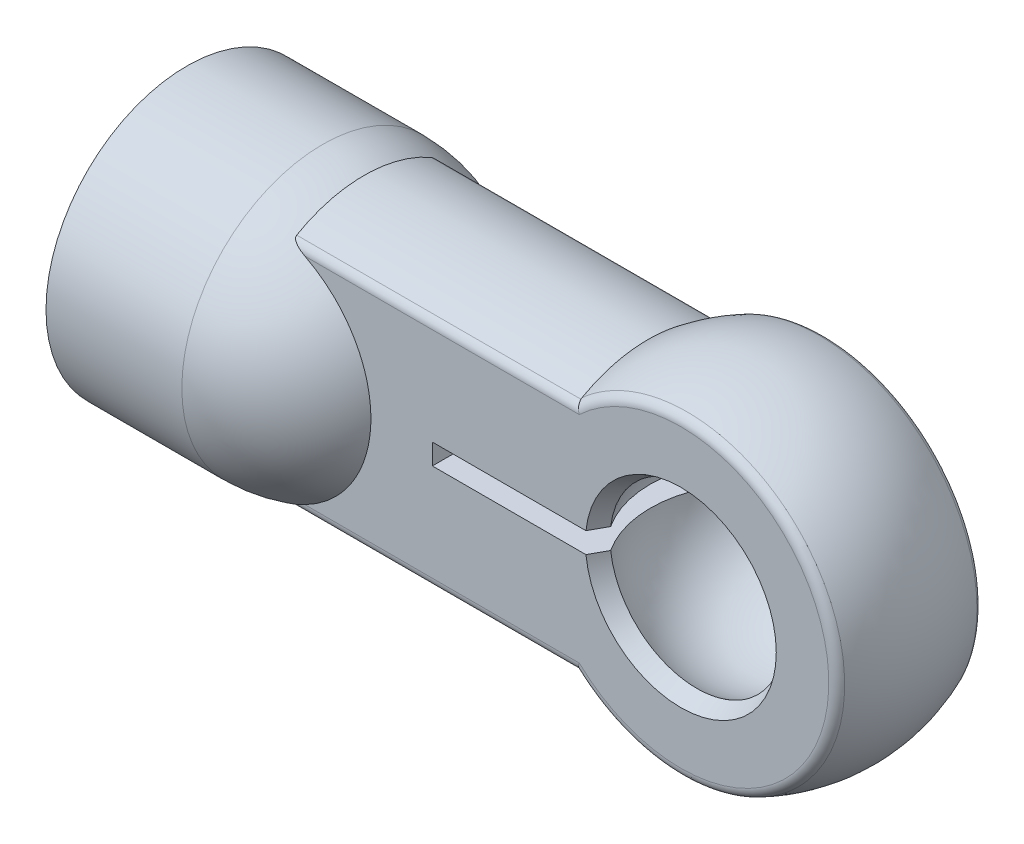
ISO-10303-21;
HEADER;
FILE_DESCRIPTION(('STEP AP214'),'2;1');
FILE_NAME('part.step','',(''),(''),'','','');
FILE_SCHEMA(('AUTOMOTIVE_DESIGN { 1 0 10303 214 1 1 1 1 }'));
ENDSEC;
DATA;
#1=APPLICATION_CONTEXT('core data for automotive mechanical design processes');
#2=APPLICATION_PROTOCOL_DEFINITION('international standard','automotive_design',2000,#1);
#3=PRODUCT_CONTEXT('',#1,'mechanical');
#4=PRODUCT('Part','Part','',(#3));
#5=PRODUCT_RELATED_PRODUCT_CATEGORY('part','',(#4));
#6=PRODUCT_DEFINITION_FORMATION('','',#4);
#7=PRODUCT_DEFINITION_CONTEXT('part definition',#1,'design');
#8=PRODUCT_DEFINITION('design','',#6,#7);
#9=PRODUCT_DEFINITION_SHAPE('','',#8);
#10=(LENGTH_UNIT() NAMED_UNIT(*) SI_UNIT(.MILLI.,.METRE.));
#11=(NAMED_UNIT(*) PLANE_ANGLE_UNIT() SI_UNIT($,.RADIAN.));
#12=(NAMED_UNIT(*) SI_UNIT($,.STERADIAN.) SOLID_ANGLE_UNIT());
#13=UNCERTAINTY_MEASURE_WITH_UNIT(LENGTH_MEASURE(1.E-05),#10,'distance_accuracy_value','');
#14=(GEOMETRIC_REPRESENTATION_CONTEXT(3) GLOBAL_UNCERTAINTY_ASSIGNED_CONTEXT((#13)) GLOBAL_UNIT_ASSIGNED_CONTEXT((#10,
#11,#12)) REPRESENTATION_CONTEXT('',''));
#15=CARTESIAN_POINT('',(0.,0.,0.));
#16=DIRECTION('',(0.,0.,1.));
#17=DIRECTION('',(1.,0.,0.));
#18=AXIS2_PLACEMENT_3D('',#15,#16,#17);
#19=CARTESIAN_POINT('',(-15.,0.,0.));
#20=DIRECTION('',(1.,0.,0.));
#21=DIRECTION('',(0.,0.,-1.));
#22=AXIS2_PLACEMENT_3D('',#19,#20,#21);
#23=PLANE('',#22);
#24=CARTESIAN_POINT('',(-15.,0.,0.));
#25=DIRECTION('',(1.,0.,0.));
#26=DIRECTION('',(0.,0.,-1.));
#27=AXIS2_PLACEMENT_3D('',#24,#25,#26);
#28=CIRCLE('',#27,2.1);
#29=CARTESIAN_POINT('',(-15.,0.,-2.1));
#30=VERTEX_POINT('',#29);
#31=EDGE_CURVE('E801',#30,#30,#28,.F.);
#32=ORIENTED_EDGE('',*,*,#31,.T.);
#33=EDGE_LOOP('',(#32));
#34=FACE_BOUND('',#33,.T.);
#35=ADVANCED_FACE('F16',(#34),#23,.F.);
#36=CARTESIAN_POINT('',(-15.,0.,0.));
#37=DIRECTION('',(1.,0.,0.));
#38=DIRECTION('',(0.,0.,-1.));
#39=AXIS2_PLACEMENT_3D('',#36,#37,#38);
#40=CYLINDRICAL_SURFACE('',#39,2.1);
#41=ORIENTED_EDGE('',*,*,#31,.F.);
#42=EDGE_LOOP('',(#41));
#43=FACE_BOUND('',#42,.T.);
#44=CARTESIAN_POINT('',(-27.36,0.,0.));
#45=DIRECTION('',(1.,0.,0.));
#46=DIRECTION('',(0.,0.,-1.));
#47=AXIS2_PLACEMENT_3D('',#44,#45,#46);
#48=CIRCLE('',#47,2.1);
#49=CARTESIAN_POINT('',(-27.36,0.,-2.1));
#50=VERTEX_POINT('',#49);
#51=EDGE_CURVE('E802',#50,#50,#48,.F.);
#52=ORIENTED_EDGE('',*,*,#51,.T.);
#53=EDGE_LOOP('',(#52));
#54=FACE_BOUND('',#53,.T.);
#55=ADVANCED_FACE('F784',(#43,#54),#40,.F.);
#56=CARTESIAN_POINT('',(-27.36,0.,0.));
#57=DIRECTION('',(1.,0.,0.));
#58=DIRECTION('',(0.,0.,-1.));
#59=AXIS2_PLACEMENT_3D('',#56,#57,#58);
#60=PLANE('',#59);
#61=ORIENTED_EDGE('',*,*,#51,.F.);
#62=EDGE_LOOP('',(#61));
#63=FACE_BOUND('',#62,.T.);
#64=CARTESIAN_POINT('',(-27.36,0.,0.));
#65=DIRECTION('',(-1.,0.,0.));
#66=DIRECTION('',(0.,0.,1.));
#67=AXIS2_PLACEMENT_3D('',#64,#65,#66);
#68=CIRCLE('',#67,6.8);
#69=CARTESIAN_POINT('',(-27.36,0.,6.8));
#70=VERTEX_POINT('',#69);
#71=EDGE_CURVE('E606',#70,#70,#68,.F.);
#72=ORIENTED_EDGE('',*,*,#71,.F.);
#73=EDGE_LOOP('',(#72));
#74=FACE_BOUND('',#73,.T.);
#75=ADVANCED_FACE('F313',(#63,#74),#60,.F.);
#76=CARTESIAN_POINT('',(-68.3447,5.196152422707,3.));
#77=DIRECTION('',(1.,0.,0.));
#78=DIRECTION('',(0.,0.,-1.));
#79=AXIS2_PLACEMENT_3D('',#76,#77,#78);
#80=CYLINDRICAL_SURFACE('',#79,0.5);
#81=DIRECTION('',(-1.,0.,0.));
#82=VECTOR('',#81,1.);
#83=CARTESIAN_POINT('',(9.9125,5.62916512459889,3.24999999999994));
#84=LINE('',#83,#82);
#85=CARTESIAN_POINT('',(-18.8025015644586,5.62916512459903,3.25000000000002));
#86=VERTEX_POINT('',#85);
#87=CARTESIAN_POINT('',(-5.07453908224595,5.62916512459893,3.24999999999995));
#88=VERTEX_POINT('',#87);
#89=EDGE_CURVE('E180',#86,#88,#84,.F.);
#90=ORIENTED_EDGE('',*,*,#89,.F.);
#91=CARTESIAN_POINT('',(-18.1561391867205,5.1961524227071,3.5));
#92=CARTESIAN_POINT('',(-18.1809328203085,5.20877080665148,3.4999955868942));
#93=CARTESIAN_POINT('',(-18.2056916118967,5.22146374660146,3.49952206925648));
#94=CARTESIAN_POINT('',(-18.2552107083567,5.24708021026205,3.49756750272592));
#95=CARTESIAN_POINT('',(-18.2799703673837,5.26000458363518,3.4960812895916));
#96=CARTESIAN_POINT('',(-18.329357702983,5.28606308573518,3.49202649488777));
#97=CARTESIAN_POINT('',(-18.3539849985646,5.29919759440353,3.489455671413));
#98=CARTESIAN_POINT('',(-18.4032077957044,5.32581042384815,3.48309214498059));
#99=CARTESIAN_POINT('',(-18.4278007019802,5.33929083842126,3.47928790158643));
#100=CARTESIAN_POINT('',(-18.4765456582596,5.36650231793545,3.47030415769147));
#101=CARTESIAN_POINT('',(-18.5006983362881,5.38023295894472,3.46512681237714));
#102=CARTESIAN_POINT('',(-18.5483665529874,5.40802563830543,3.45314364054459));
#103=CARTESIAN_POINT('',(-18.5718829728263,5.42208716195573,3.44634020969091));
#104=CARTESIAN_POINT('',(-18.6114926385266,5.44667329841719,3.43287029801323));
#105=CARTESIAN_POINT('',(-18.62782159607,5.45708651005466,3.42669827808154));
#106=CARTESIAN_POINT('',(-18.6597580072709,5.47823329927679,3.41302474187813));
#107=CARTESIAN_POINT('',(-18.6753642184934,5.48896737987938,3.40552103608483));
#108=CARTESIAN_POINT('',(-18.7055509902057,5.5109095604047,3.38874352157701));
#109=CARTESIAN_POINT('',(-18.7201193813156,5.52212139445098,3.3794523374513));
#110=CARTESIAN_POINT('',(-18.747202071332,5.54493306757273,3.35859438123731));
#111=CARTESIAN_POINT('',(-18.759724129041,5.55653123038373,3.34703658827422));
#112=CARTESIAN_POINT('',(-18.7759586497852,5.5743047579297,3.32723573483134));
#113=CARTESIAN_POINT('',(-18.7810184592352,5.58041766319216,3.3200552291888));
#114=CARTESIAN_POINT('',(-18.7897549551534,5.59257273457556,3.30486882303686));
#115=CARTESIAN_POINT('',(-18.7934369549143,5.59861508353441,3.29686624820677));
#116=CARTESIAN_POINT('',(-18.7982658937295,5.60881255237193,3.28242918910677));
#117=CARTESIAN_POINT('',(-18.7998329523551,5.61302554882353,3.27617684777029));
#118=CARTESIAN_POINT('',(-18.8019607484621,5.6212668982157,3.26332004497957));
#119=CARTESIAN_POINT('',(-18.802513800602,5.62529361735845,3.25671328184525));
#120=CARTESIAN_POINT('',(-18.8025015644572,5.62916512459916,3.25000000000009));
#121=B_SPLINE_CURVE_WITH_KNOTS('',3,(#91,#92,#93,#94,#95,#96,#97,#98,#99,#100,#101,#102,#103,
#104,#105,#106,#107,#108,#109,#110,#111,#112,#113,#114,#115,#116,#117,#118,#119,#120),
.UNSPECIFIED.,.F.,.F.,(4,2,2,2,2,2,2,2,2,2,2,2,2,2,4),(0.,0.083459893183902,0.167348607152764,
0.251411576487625,0.336284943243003,0.42102587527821,0.505642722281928,0.566580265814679,
0.627618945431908,0.689284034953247,0.750709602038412,0.782724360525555,0.814614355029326,
0.837643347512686,0.860846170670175),.UNSPECIFIED.);
#122=CARTESIAN_POINT('',(-18.1561391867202,5.19615242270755,3.5));
#123=VERTEX_POINT('',#122);
#124=EDGE_CURVE('E294',#123,#86,#121,.T.);
#125=ORIENTED_EDGE('',*,*,#124,.F.);
#126=DIRECTION('',(-1.,0.,0.));
#127=VECTOR('',#126,1.);
#128=CARTESIAN_POINT('',(8.25,5.196152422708,3.5));
#129=LINE('',#128,#127);
#130=CARTESIAN_POINT('',(-4.905354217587,5.196152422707,3.5));
#131=VERTEX_POINT('',#130);
#132=EDGE_CURVE('E258',#123,#131,#129,.F.);
#133=ORIENTED_EDGE('',*,*,#132,.T.);
#134=CARTESIAN_POINT('',(-5.07453908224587,5.62916512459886,3.24999999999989));
#135=CARTESIAN_POINT('',(-5.07355903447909,5.62661398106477,3.2544186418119));
#136=CARTESIAN_POINT('',(-5.07255463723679,5.62399687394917,3.25879374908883));
#137=CARTESIAN_POINT('',(-5.07048626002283,5.61860456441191,3.26750186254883));
#138=CARTESIAN_POINT('',(-5.06942173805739,5.61582791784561,3.27183384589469));
#139=CARTESIAN_POINT('',(-5.06723206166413,5.61011599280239,3.28044928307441));
#140=CARTESIAN_POINT('',(-5.06610636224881,5.60717928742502,3.28473165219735));
#141=CARTESIAN_POINT('',(-5.06379345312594,5.60114690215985,3.29324131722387));
#142=CARTESIAN_POINT('',(-5.06260569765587,5.59804981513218,3.29746746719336));
#143=CARTESIAN_POINT('',(-5.06016793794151,5.59169652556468,3.30585798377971));
#144=CARTESIAN_POINT('',(-5.05891738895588,5.5884389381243,3.31002114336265));
#145=CARTESIAN_POINT('',(-5.05635346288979,5.58176471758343,3.31827882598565));
#146=CARTESIAN_POINT('',(-5.05503954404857,5.57834672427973,3.32237208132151));
#147=CARTESIAN_POINT('',(-5.05234846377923,5.57135198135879,3.3304829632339));
#148=CARTESIAN_POINT('',(-5.05097076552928,5.56777389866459,3.33449926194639));
#149=CARTESIAN_POINT('',(-5.04815188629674,5.56045949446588,3.34244910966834));
#150=CARTESIAN_POINT('',(-5.04671017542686,5.55672186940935,3.34638127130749));
#151=CARTESIAN_POINT('',(-5.04376321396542,5.54908913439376,3.35415560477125));
#152=CARTESIAN_POINT('',(-5.04225744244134,5.54519275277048,3.35799633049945));
#153=CARTESIAN_POINT('',(-5.03918249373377,5.53724350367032,3.36558044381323));
#154=CARTESIAN_POINT('',(-5.03761280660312,5.53318939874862,3.36932232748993));
#155=CARTESIAN_POINT('',(-5.03441036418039,5.52492595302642,3.37670131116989));
#156=CARTESIAN_POINT('',(-5.03277711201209,5.52071541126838,3.38033685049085));
#157=CARTESIAN_POINT('',(-5.029448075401,5.51214060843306,3.38749561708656));
#158=CARTESIAN_POINT('',(-5.02775180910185,5.50777518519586,3.39101722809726));
#159=CARTESIAN_POINT('',(-5.02429753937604,5.49889237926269,3.39794053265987));
#160=CARTESIAN_POINT('',(-5.02253907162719,5.49437387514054,3.40134055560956));
#161=CARTESIAN_POINT('',(-5.018961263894,5.48518703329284,3.4080130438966));
#162=CARTESIAN_POINT('',(-5.01714147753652,5.48051761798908,3.4112837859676));
#163=CARTESIAN_POINT('',(-5.01344272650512,5.47103101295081,3.41768994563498));
#164=CARTESIAN_POINT('',(-5.01156334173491,5.46621278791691,3.42082358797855));
#165=CARTESIAN_POINT('',(-5.00774507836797,5.45643222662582,3.42694807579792));
#166=CARTESIAN_POINT('',(-5.00580578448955,5.4514689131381,3.42993709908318));
#167=CARTESIAN_POINT('',(-5.00087349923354,5.4388272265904,3.43725035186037));
#168=CARTESIAN_POINT('',(-4.99786013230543,5.43108713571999,3.44145484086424));
#169=CARTESIAN_POINT('',(-4.99154436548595,5.41484669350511,3.44972687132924));
#170=CARTESIAN_POINT('',(-4.98823687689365,5.40633197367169,3.4537622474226));
#171=CARTESIAN_POINT('',(-4.98131307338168,5.38853243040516,3.46159398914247));
#172=CARTESIAN_POINT('',(-4.97769101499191,5.37923450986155,3.46535565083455));
#173=CARTESIAN_POINT('',(-4.97210639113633,5.36493218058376,3.47065145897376));
#174=CARTESIAN_POINT('',(-4.97017488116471,5.35999151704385,3.47239337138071));
#175=CARTESIAN_POINT('',(-4.96623061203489,5.34991586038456,3.47576982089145));
#176=CARTESIAN_POINT('',(-4.96421716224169,5.34477950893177,3.47739951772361));
#177=CARTESIAN_POINT('',(-4.96010882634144,5.33431378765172,3.48053591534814));
#178=CARTESIAN_POINT('',(-4.95801328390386,5.32898317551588,3.48203760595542));
#179=CARTESIAN_POINT('',(-4.95374101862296,5.31813063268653,3.48490199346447));
#180=CARTESIAN_POINT('',(-4.95156368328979,5.31260757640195,3.48625951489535));
#181=CARTESIAN_POINT('',(-4.94712872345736,5.30137261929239,3.48881907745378));
#182=CARTESIAN_POINT('',(-4.94487054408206,5.29565972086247,3.49001577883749));
#183=CARTESIAN_POINT('',(-4.94027543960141,5.28404828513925,3.49223681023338));
#184=CARTESIAN_POINT('',(-4.93793802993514,5.27814888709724,3.49325563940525));
#185=CARTESIAN_POINT('',(-4.93318672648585,5.26616846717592,3.49510366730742));
#186=CARTESIAN_POINT('',(-4.93077243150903,5.26008673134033,3.49592720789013));
#187=CARTESIAN_POINT('',(-4.92587039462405,5.24774650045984,3.49736709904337));
#188=CARTESIAN_POINT('',(-4.92338234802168,5.24148744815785,3.4979776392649));
#189=CARTESIAN_POINT('',(-4.91833666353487,5.22879835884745,3.49897370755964));
#190=CARTESIAN_POINT('',(-4.91577883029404,5.22236793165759,3.4993532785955));
#191=CARTESIAN_POINT('',(-4.91059835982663,5.20934278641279,3.49986950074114));
#192=CARTESIAN_POINT('',(-4.90797565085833,5.20274785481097,3.50000005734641));
#193=CARTESIAN_POINT('',(-4.905354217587,5.196152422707,3.5));
#194=B_SPLINE_CURVE_WITH_KNOTS('',3,(#134,#135,#136,#137,#138,#139,#140,#141,#142,#143,#144,
#145,#146,#147,#148,#149,#150,#151,#152,#153,#154,#155,#156,#157,#158,#159,#160,#161,#162,#163,
#164,#165,#166,#167,#168,#169,#170,#171,#172,#173,#174,#175,#176,#177,#178,#179,#180,#181,#182,
#183,#184,#185,#186,#187,#188,#189,#190,#191,#192,#193),.UNSPECIFIED.,.F.,.F.,(4,2,2,2,2,2,2,2,
2,2,2,2,2,2,2,2,2,2,2,2,2,2,2,2,2,2,2,2,2,4),(0.,0.0155857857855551,0.0313464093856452,
0.0472833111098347,0.0633978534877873,0.0796913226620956,0.0961649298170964,0.11281981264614,
0.129657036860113,0.146677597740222,0.163882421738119,0.181272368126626,0.198848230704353,
0.216610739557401,0.234560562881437,0.25269830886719,0.271024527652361,0.298940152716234,
0.328884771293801,0.360857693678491,0.377606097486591,0.394860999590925,0.412622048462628,
0.430888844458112,0.44966094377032,0.468937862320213,0.488719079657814,0.509004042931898,
0.529792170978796,0.551082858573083),.UNSPECIFIED.);
#195=EDGE_CURVE('E175',#88,#131,#194,.T.);
#196=ORIENTED_EDGE('',*,*,#195,.F.);
#197=EDGE_LOOP('',(#90,#125,#133,#196));
#198=FACE_BOUND('',#197,.T.);
#199=ADVANCED_FACE('F308',(#198),#80,.T.);
#200=CARTESIAN_POINT('',(0.,0.,3.));
#201=DIRECTION('',(0.,0.,-1.));
#202=DIRECTION('',(0.998982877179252,-0.0450911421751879,0.));
#203=AXIS2_PLACEMENT_3D('',#200,#201,#202);
#204=TOROIDAL_SURFACE('',#203,7.145802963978,0.5);
#205=CARTESIAN_POINT('',(-5.080600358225,-5.66138222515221,3.19354838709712));
#206=CARTESIAN_POINT('',(-5.08060034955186,-5.660017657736,3.19596743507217));
#207=CARTESIAN_POINT('',(-5.0805689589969,-5.6586515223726,3.19838563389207));
#208=CARTESIAN_POINT('',(-5.08044262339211,-5.65592585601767,3.20320313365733));
#209=CARTESIAN_POINT('',(-5.08034809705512,-5.6545663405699,3.20560245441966));
#210=CARTESIAN_POINT('',(-5.0800954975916,-5.65185397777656,3.21038223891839));
#211=CARTESIAN_POINT('',(-5.07993781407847,-5.65050114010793,3.21276272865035));
#212=CARTESIAN_POINT('',(-5.0795589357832,-5.64780220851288,3.21750487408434));
#213=CARTESIAN_POINT('',(-5.07933809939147,-5.6464561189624,3.21986656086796));
#214=CARTESIAN_POINT('',(-5.07883294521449,-5.64377075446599,3.22457112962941));
#215=CARTESIAN_POINT('',(-5.07854895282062,-5.64243147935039,3.22691404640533));
#216=CARTESIAN_POINT('',(-5.07791752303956,-5.63975981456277,3.23158110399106));
#217=CARTESIAN_POINT('',(-5.07757037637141,-5.63842742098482,3.2339052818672));
#218=CARTESIAN_POINT('',(-5.07681266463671,-5.63576958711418,3.23853489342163));
#219=CARTESIAN_POINT('',(-5.07640235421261,-5.63444414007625,3.24084036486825));
#220=CARTESIAN_POINT('',(-5.07551838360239,-5.63180027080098,3.24543259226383));
#221=CARTESIAN_POINT('',(-5.07504494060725,-5.63048183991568,3.2477193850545));
#222=CARTESIAN_POINT('',(-5.074539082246,-5.62916512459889,3.24999999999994));
#223=B_SPLINE_CURVE_WITH_KNOTS('',3,(#205,#206,#207,#208,#209,#210,#211,#212,#213,#214,#215,
#216,#217,#218,#219,#220,#221,#222),.UNSPECIFIED.,.F.,.F.,(4,2,2,2,2,2,2,2,4),(0.,
0.00833200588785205,0.0166092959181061,0.0248362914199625,0.0330174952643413,0.0411574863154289,
0.0492609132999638,0.0573324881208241,0.0653769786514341),.UNSPECIFIED.);
#224=CARTESIAN_POINT('',(-5.08060035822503,-5.66138222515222,3.1935483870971));
#225=VERTEX_POINT('',#224);
#226=CARTESIAN_POINT('',(-5.07453908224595,-5.62916512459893,3.24999999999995));
#227=VERTEX_POINT('',#226);
#228=EDGE_CURVE('E173',#225,#227,#223,.T.);
#229=ORIENTED_EDGE('',*,*,#228,.F.);
#230=CARTESIAN_POINT('',(0.,0.,3.19354838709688));
#231=DIRECTION('',(0.,0.,-1.));
#232=DIRECTION('',(0.998982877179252,-0.0450911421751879,0.));
#233=AXIS2_PLACEMENT_3D('',#230,#231,#232);
#234=CIRCLE('',#233,7.60682251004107);
#235=CARTESIAN_POINT('',(-5.080600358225,5.66138222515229,3.193548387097));
#236=VERTEX_POINT('',#235);
#237=EDGE_CURVE('E156',#225,#236,#234,.F.);
#238=ORIENTED_EDGE('',*,*,#237,.T.);
#239=CARTESIAN_POINT('',(-5.074539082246,5.62916512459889,3.24999999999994));
#240=CARTESIAN_POINT('',(-5.07504494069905,5.63048184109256,3.24771938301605));
#241=CARTESIAN_POINT('',(-5.07551838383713,5.63180027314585,3.24543258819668));
#242=CARTESIAN_POINT('',(-5.07640235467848,5.63444414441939,3.24084035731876));
#243=CARTESIAN_POINT('',(-5.07681266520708,5.63576959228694,3.23853488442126));
#244=CARTESIAN_POINT('',(-5.0775703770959,5.6384274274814,3.23390527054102));
#245=CARTESIAN_POINT('',(-5.07791752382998,5.6397598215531,3.23158109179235));
#246=CARTESIAN_POINT('',(-5.0785489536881,5.64243148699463,3.22691403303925));
#247=CARTESIAN_POINT('',(-5.07883294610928,5.64377076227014,3.22457111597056));
#248=CARTESIAN_POINT('',(-5.07933810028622,5.64645612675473,3.2198665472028));
#249=CARTESIAN_POINT('',(-5.07955893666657,5.64780221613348,3.21750486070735));
#250=CARTESIAN_POINT('',(-5.0799378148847,5.65050114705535,3.2127627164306));
#251=CARTESIAN_POINT('',(-5.08009549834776,5.65185398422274,3.21038222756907));
#252=CARTESIAN_POINT('',(-5.0803480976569,5.65456634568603,3.20560244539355));
#253=CARTESIAN_POINT('',(-5.0804426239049,5.65592586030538,3.20320312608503));
#254=CARTESIAN_POINT('',(-5.08056895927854,5.65865152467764,3.19838562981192));
#255=CARTESIAN_POINT('',(-5.08060034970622,5.66001765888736,3.19596743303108));
#256=CARTESIAN_POINT('',(-5.080600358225,5.66138222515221,3.19354838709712));
#257=B_SPLINE_CURVE_WITH_KNOTS('',3,(#239,#240,#241,#242,#243,#244,#245,#246,#247,#248,#249,
#250,#251,#252,#253,#254,#255,#256),.UNSPECIFIED.,.F.,.F.,(4,2,2,2,2,2,2,2,4),(0.,
0.00804449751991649,0.0161160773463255,0.0242195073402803,0.032359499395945,0.0405407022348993,
0.0487676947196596,0.0570449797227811,0.0653769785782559),.UNSPECIFIED.);
#258=EDGE_CURVE('E166',#88,#236,#257,.T.);
#259=ORIENTED_EDGE('',*,*,#258,.F.);
#260=ORIENTED_EDGE('',*,*,#195,.T.);
#261=CARTESIAN_POINT('',(0.,0.,3.5));
#262=DIRECTION('',(0.,0.,-1.));
#263=DIRECTION('',(-0.686466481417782,0.727161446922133,0.));
#264=AXIS2_PLACEMENT_3D('',#261,#262,#263);
#265=CIRCLE('',#264,7.14580296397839);
#266=CARTESIAN_POINT('',(7.13853480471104,-0.322212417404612,3.5));
#267=VERTEX_POINT('',#266);
#268=EDGE_CURVE('E227',#131,#267,#265,.T.);
#269=ORIENTED_EDGE('',*,*,#268,.T.);
#270=CARTESIAN_POINT('',(0.,0.,3.5));
#271=DIRECTION('',(0.,0.,-1.));
#272=DIRECTION('',(0.998982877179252,-0.0450911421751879,0.));
#273=AXIS2_PLACEMENT_3D('',#270,#271,#272);
#274=CIRCLE('',#273,7.14580296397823);
#275=CARTESIAN_POINT('',(-4.90535421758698,-5.19615242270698,3.5));
#276=VERTEX_POINT('',#275);
#277=EDGE_CURVE('E359',#267,#276,#274,.T.);
#278=ORIENTED_EDGE('',*,*,#277,.T.);
#279=CARTESIAN_POINT('',(-4.905354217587,-5.196152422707,3.5));
#280=CARTESIAN_POINT('',(-4.90797491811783,-5.20274601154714,3.50000005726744));
#281=CARTESIAN_POINT('',(-4.91059688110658,-5.20933910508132,3.49986957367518));
#282=CARTESIAN_POINT('',(-4.91577574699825,-5.22236035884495,3.49935365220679));
#283=CARTESIAN_POINT('',(-4.9183327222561,-5.22878873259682,3.49897431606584));
#284=CARTESIAN_POINT('',(-4.92337658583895,-5.24147350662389,3.49797889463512));
#285=CARTESIAN_POINT('',(-4.92586367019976,-5.24773029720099,3.49736877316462));
#286=CARTESIAN_POINT('',(-4.93076368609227,-5.26006580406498,3.4959299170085));
#287=CARTESIAN_POINT('',(-4.93317692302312,-5.2661450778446,3.49510699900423));
#288=CARTESIAN_POINT('',(-4.93792602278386,-5.27812038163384,3.49326043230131));
#289=CARTESIAN_POINT('',(-4.94026228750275,-5.28401712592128,3.49224244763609));
#290=CARTESIAN_POINT('',(-4.94485502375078,-5.29562307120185,3.49002333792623));
#291=CARTESIAN_POINT('',(-4.9471119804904,-5.30133313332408,3.48882771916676));
#292=CARTESIAN_POINT('',(-4.95154442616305,-5.31256224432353,3.48627056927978));
#293=CARTESIAN_POINT('',(-4.95372047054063,-5.31808229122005,3.48491438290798));
#294=CARTESIAN_POINT('',(-4.95799009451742,-5.32892865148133,3.48205292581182));
#295=CARTESIAN_POINT('',(-4.96008428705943,-5.33425609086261,3.48055283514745));
#296=CARTESIAN_POINT('',(-4.96418987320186,-5.34471531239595,3.47741990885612));
#297=CARTESIAN_POINT('',(-4.96620192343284,-5.34984833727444,3.4757920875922));
#298=CARTESIAN_POINT('',(-4.97014335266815,-5.35991719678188,3.47241966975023));
#299=CARTESIAN_POINT('',(-4.9720734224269,-5.36485439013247,3.47067991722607));
#300=CARTESIAN_POINT('',(-4.97765354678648,-5.37914575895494,3.46539110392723));
#301=CARTESIAN_POINT('',(-4.98127262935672,-5.38843633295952,3.46163464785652));
#302=CARTESIAN_POINT('',(-4.98819041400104,-5.40622071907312,3.45381450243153));
#303=CARTESIAN_POINT('',(-4.99149485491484,-5.41472762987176,3.44978553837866));
#304=CARTESIAN_POINT('',(-4.99780455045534,-5.43095203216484,3.44152753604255));
#305=CARTESIAN_POINT('',(-5.00081488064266,-5.43868389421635,3.43733067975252));
#306=CARTESIAN_POINT('',(-5.00574633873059,-5.45132249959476,3.43002504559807));
#307=CARTESIAN_POINT('',(-5.00768768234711,-5.45629059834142,3.42703537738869));
#308=CARTESIAN_POINT('',(-5.01150992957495,-5.46608053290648,3.42090934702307));
#309=CARTESIAN_POINT('',(-5.01339124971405,-5.47090334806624,3.41777481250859));
#310=CARTESIAN_POINT('',(-5.01709377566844,-5.48039891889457,3.4113666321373));
#311=CARTESIAN_POINT('',(-5.01891540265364,-5.48507271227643,3.40809476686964));
#312=CARTESIAN_POINT('',(-5.02249678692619,-5.49426809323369,3.40141981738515));
#313=CARTESIAN_POINT('',(-5.02425699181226,-5.49879076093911,3.39801846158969));
#314=CARTESIAN_POINT('',(-5.02771463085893,-5.50768167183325,3.39109229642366));
#315=CARTESIAN_POINT('',(-5.02941253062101,-5.51205103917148,3.38756916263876));
#316=CARTESIAN_POINT('',(-5.03274472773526,-5.52063350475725,3.38040717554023));
#317=CARTESIAN_POINT('',(-5.03437950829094,-5.52484776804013,3.37676994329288));
#318=CARTESIAN_POINT('',(-5.03758490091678,-5.53311842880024,3.3693874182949));
#319=CARTESIAN_POINT('',(-5.03915601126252,-5.53717603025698,3.3656436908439));
#320=CARTESIAN_POINT('',(-5.04223370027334,-5.54513204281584,3.35805575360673));
#321=CARTESIAN_POINT('',(-5.04374079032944,-5.54903169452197,3.35421305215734));
#322=CARTESIAN_POINT('',(-5.04669028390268,-5.55667073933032,3.34643464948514));
#323=CARTESIAN_POINT('',(-5.04813320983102,-5.56041140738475,3.34250039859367));
#324=CARTESIAN_POINT('',(-5.05095441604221,-5.56773166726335,3.33454627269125));
#325=CARTESIAN_POINT('',(-5.05233322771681,-5.57131256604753,3.3305277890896));
#326=CARTESIAN_POINT('',(-5.05502643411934,-5.57831271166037,3.32241245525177));
#327=CARTESIAN_POINT('',(-5.05634136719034,-5.5817332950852,3.3183169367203));
#328=CARTESIAN_POINT('',(-5.0589072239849,-5.58841246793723,3.31005466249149));
#329=CARTESIAN_POINT('',(-5.06015869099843,-5.59167242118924,3.30588917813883));
#330=CARTESIAN_POINT('',(-5.06259819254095,-5.59803021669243,3.29749396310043));
#331=CARTESIAN_POINT('',(-5.06378677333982,-5.60112944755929,3.29326544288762));
#332=CARTESIAN_POINT('',(-5.06610124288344,-5.60716589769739,3.2847510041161));
#333=CARTESIAN_POINT('',(-5.06722767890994,-5.61010452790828,3.28046623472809));
#334=CARTESIAN_POINT('',(-5.06941874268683,-5.6158200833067,3.27184597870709));
#335=CARTESIAN_POINT('',(-5.07048391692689,-5.61859843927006,3.26751157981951));
#336=CARTESIAN_POINT('',(-5.07255351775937,-5.62399395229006,3.25879863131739));
#337=CARTESIAN_POINT('',(-5.07355848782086,-5.62661255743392,3.25442110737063));
#338=CARTESIAN_POINT('',(-5.07453908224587,-5.62916512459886,3.24999999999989));
#339=B_SPLINE_CURVE_WITH_KNOTS('',3,(#279,#280,#281,#282,#283,#284,#285,#286,#287,#288,#289,
#290,#291,#292,#293,#294,#295,#296,#297,#298,#299,#300,#301,#302,#303,#304,#305,#306,#307,#308,
#309,#310,#311,#312,#313,#314,#315,#316,#317,#318,#319,#320,#321,#322,#323,#324,#325,#326,#327,
#328,#329,#330,#331,#332,#333,#334,#335,#336,#337,#338),.UNSPECIFIED.,.F.,.F.,(4,2,2,2,2,2,2,2,
2,2,2,2,2,2,2,2,2,2,2,2,2,2,2,2,2,2,2,2,2,4),(0.,0.0212847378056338,0.042066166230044,
0.0623436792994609,0.0821166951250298,0.101384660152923,0.120147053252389,0.138403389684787,
0.156153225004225,0.173396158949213,0.190131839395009,0.222077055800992,0.251990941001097,
0.279872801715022,0.29821357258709,0.316365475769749,0.334329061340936,0.352104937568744,
0.369693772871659,0.387096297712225,0.404313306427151,0.421345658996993,0.43819428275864,
0.454860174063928,0.471344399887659,0.487648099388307,0.503772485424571,0.519718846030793,
0.53548854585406,0.55108302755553),.UNSPECIFIED.);
#340=EDGE_CURVE('E174',#227,#276,#339,.F.);
#341=ORIENTED_EDGE('',*,*,#340,.F.);
#342=EDGE_LOOP('',(#229,#238,#259,#260,#269,#278,#341));
#343=FACE_BOUND('',#342,.T.);
#344=ADVANCED_FACE('F171',(#343),#204,.T.);
#345=CARTESIAN_POINT('',(51.5947,-5.196152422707,3.));
#346=DIRECTION('',(-1.,0.,0.));
#347=DIRECTION('',(0.,0.,1.));
#348=AXIS2_PLACEMENT_3D('',#345,#346,#347);
#349=CYLINDRICAL_SURFACE('',#348,0.5);
#350=DIRECTION('',(-1.,0.,0.));
#351=VECTOR('',#350,1.);
#352=CARTESIAN_POINT('',(8.25,-5.196152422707,3.5));
#353=LINE('',#352,#351);
#354=CARTESIAN_POINT('',(-18.1561391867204,-5.19615242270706,3.5));
#355=VERTEX_POINT('',#354);
#356=EDGE_CURVE('E354',#276,#355,#353,.T.);
#357=ORIENTED_EDGE('',*,*,#356,.T.);
#358=CARTESIAN_POINT('',(-18.8025015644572,-5.62916512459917,3.25000000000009));
#359=CARTESIAN_POINT('',(-18.8025362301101,-5.623916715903,3.25911214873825));
#360=CARTESIAN_POINT('',(-18.8015066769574,-5.61838991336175,3.26800088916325));
#361=CARTESIAN_POINT('',(-18.7976575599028,-5.60708314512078,3.28501886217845));
#362=CARTESIAN_POINT('',(-18.7948656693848,-5.60130835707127,3.29315764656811));
#363=CARTESIAN_POINT('',(-18.7868534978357,-5.58804852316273,3.31075935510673));
#364=CARTESIAN_POINT('',(-18.7811793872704,-5.58052531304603,3.31998077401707));
#365=CARTESIAN_POINT('',(-18.7681448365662,-5.56548551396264,3.33723098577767));
#366=CARTESIAN_POINT('',(-18.7607734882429,-5.55796929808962,3.34525148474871));
#367=CARTESIAN_POINT('',(-18.7384809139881,-5.53704762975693,3.36627578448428));
#368=CARTESIAN_POINT('',(-18.7222792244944,-5.52380127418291,3.3780563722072));
#369=CARTESIAN_POINT('',(-18.6879770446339,-5.49783456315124,3.39908099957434));
#370=CARTESIAN_POINT('',(-18.669872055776,-5.48511555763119,3.40831883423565));
#371=CARTESIAN_POINT('',(-18.6234547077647,-5.45399449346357,3.42897390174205));
#372=CARTESIAN_POINT('',(-18.5944728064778,-5.43584811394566,3.43925469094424));
#373=CARTESIAN_POINT('',(-18.5352427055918,-5.40017834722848,3.4569099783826));
#374=CARTESIAN_POINT('',(-18.5049919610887,-5.38265635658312,3.46427829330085));
#375=CARTESIAN_POINT('',(-18.44369672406,-5.34803408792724,3.47672924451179));
#376=CARTESIAN_POINT('',(-18.4126505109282,-5.33093491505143,3.48180638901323));
#377=CARTESIAN_POINT('',(-18.3501125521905,-5.2970864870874,3.4900154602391));
#378=CARTESIAN_POINT('',(-18.3186207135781,-5.28033730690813,3.4931469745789));
#379=CARTESIAN_POINT('',(-18.2652208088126,-5.25230399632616,3.4969707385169));
#380=CARTESIAN_POINT('',(-18.243383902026,-5.24094310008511,3.49811899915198));
#381=CARTESIAN_POINT('',(-18.1997536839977,-5.21842007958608,3.49963006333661));
#382=CARTESIAN_POINT('',(-18.1779609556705,-5.20725715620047,3.49999773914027));
#383=CARTESIAN_POINT('',(-18.1561391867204,-5.19615242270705,3.5));
#384=B_SPLINE_CURVE_WITH_KNOTS('',3,(#358,#359,#360,#361,#362,#363,#364,#365,#366,#367,#368,
#369,#370,#371,#372,#373,#374,#375,#376,#377,#378,#379,#380,#381,#382,#383),.UNSPECIFIED.,.F.,
.F.,(4,2,2,2,2,2,2,2,2,2,2,2,4),(0.,0.031403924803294,0.0623265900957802,0.101655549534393,
0.141244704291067,0.212888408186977,0.284705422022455,0.391569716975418,0.498659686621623,
0.606004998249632,0.713373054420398,0.787287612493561,0.860739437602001),.UNSPECIFIED.);
#385=CARTESIAN_POINT('',(-18.8025015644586,-5.62916512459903,3.25000000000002));
#386=VERTEX_POINT('',#385);
#387=EDGE_CURVE('E303',#386,#355,#384,.T.);
#388=ORIENTED_EDGE('',*,*,#387,.F.);
#389=DIRECTION('',(-1.,0.,0.));
#390=VECTOR('',#389,1.);
#391=CARTESIAN_POINT('',(9.9125,-5.62916512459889,3.24999999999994));
#392=LINE('',#391,#390);
#393=EDGE_CURVE('E356',#227,#386,#392,.T.);
#394=ORIENTED_EDGE('',*,*,#393,.F.);
#395=ORIENTED_EDGE('',*,*,#340,.T.);
#396=EDGE_LOOP('',(#357,#388,#394,#395));
#397=FACE_BOUND('',#396,.T.);
#398=ADVANCED_FACE('F352',(#397),#349,.T.);
#399=CARTESIAN_POINT('',(0.,0.,3.50000187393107));
#400=DIRECTION('',(0.,0.,1.));
#401=DIRECTION('',(1.,0.,0.));
#402=AXIS2_PLACEMENT_3D('',#399,#400,#401);
#403=CONICAL_SURFACE('',#402,4.60970813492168,0.4969265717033);
#404=CARTESIAN_POINT('',(-4.16073435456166,0.500000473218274,2.72732089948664));
#405=CARTESIAN_POINT('',(-4.23106419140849,0.500000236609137,2.85608268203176));
#406=CARTESIAN_POINT('',(-4.30137718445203,0.500000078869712,2.98485365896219));
#407=CARTESIAN_POINT('',(-4.44196948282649,0.499999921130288,3.2424140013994));
#408=CARTESIAN_POINT('',(-4.51224878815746,0.499999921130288,3.37120336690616));
#409=CARTESIAN_POINT('',(-4.58251124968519,0.5,3.5000019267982));
#410=B_SPLINE_CURVE_WITH_KNOTS('',3,(#404,#405,#406,#407,#408,#409),.UNSPECIFIED.,.F.,.F.,(4,2,
4),(0.,0.440151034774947,0.880302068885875),.UNSPECIFIED.);
#411=CARTESIAN_POINT('',(-4.1607343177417,0.499999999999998,2.72732172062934));
#412=VERTEX_POINT('',#411);
#413=CARTESIAN_POINT('',(-4.58251072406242,0.5,3.5000009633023));
#414=VERTEX_POINT('',#413);
#415=EDGE_CURVE('E589',#412,#414,#410,.T.);
#416=ORIENTED_EDGE('',*,*,#415,.F.);
#417=CARTESIAN_POINT('',(0.,0.,2.72732233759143));
#418=DIRECTION('',(0.,0.,1.));
#419=DIRECTION('',(1.,0.,0.));
#420=AXIS2_PLACEMENT_3D('',#417,#418,#419);
#421=CIRCLE('',#420,4.19066973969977);
#422=CARTESIAN_POINT('',(-4.16073469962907,-0.499999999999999,2.72732241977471));
#423=VERTEX_POINT('',#422);
#424=EDGE_CURVE('E165',#412,#423,#421,.F.);
#425=ORIENTED_EDGE('',*,*,#424,.T.);
#426=CARTESIAN_POINT('',(-4.58251134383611,-0.500000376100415,3.50000138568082));
#427=CARTESIAN_POINT('',(-4.51224895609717,-0.500000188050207,3.37120316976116));
#428=CARTESIAN_POINT('',(-4.44196971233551,-0.500000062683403,3.24241415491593));
#429=CARTESIAN_POINT('',(-4.30137751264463,-0.499999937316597,2.9848545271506));
#430=CARTESIAN_POINT('',(-4.23106455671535,-0.499999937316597,2.85608391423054));
#431=CARTESIAN_POINT('',(-4.16073474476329,-0.5,2.72732250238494));
#432=B_SPLINE_CURVE_WITH_KNOTS('',3,(#426,#427,#428,#429,#430,#431),.UNSPECIFIED.,.F.,.F.,(4,2,
4),(0.,0.440150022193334,0.880300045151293),.UNSPECIFIED.);
#433=CARTESIAN_POINT('',(-4.5825106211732,-0.5,3.50000077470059));
#434=VERTEX_POINT('',#433);
#435=EDGE_CURVE('E357',#434,#423,#432,.T.);
#436=ORIENTED_EDGE('',*,*,#435,.F.);
#437=CARTESIAN_POINT('',(0.,0.,3.5));
#438=DIRECTION('',(0.,0.,-1.));
#439=DIRECTION('',(-1.,0.,0.));
#440=AXIS2_PLACEMENT_3D('',#437,#438,#439);
#441=CIRCLE('',#440,4.60970711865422);
#442=EDGE_CURVE('E260',#434,#414,#441,.F.);
#443=ORIENTED_EDGE('',*,*,#442,.T.);
#444=EDGE_LOOP('',(#416,#425,#436,#443));
#445=FACE_BOUND('',#444,.T.);
#446=ADVANCED_FACE('F614',(#445),#403,.F.);
#447=CARTESIAN_POINT('',(-13.2,0.,0.));
#448=DIRECTION('',(-1.,0.,0.));
#449=DIRECTION('',(0.,0.,1.));
#450=AXIS2_PLACEMENT_3D('',#447,#448,#449);
#451=CYLINDRICAL_SURFACE('',#450,6.8);
#452=CARTESIAN_POINT('',(-20.8,0.,0.));
#453=DIRECTION('',(1.,0.,4.90653188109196E-11));
#454=DIRECTION('',(0.,1.,0.));
#455=AXIS2_PLACEMENT_3D('',#452,#453,#454);
#456=CIRCLE('',#455,6.8);
#457=CARTESIAN_POINT('',(-20.8,6.8,0.));
#458=VERTEX_POINT('',#457);
#459=CARTESIAN_POINT('',(-20.8,-6.8,0.));
#460=VERTEX_POINT('',#459);
#461=EDGE_CURVE('E604',#458,#460,#456,.T.);
#462=ORIENTED_EDGE('',*,*,#461,.F.);
#463=CARTESIAN_POINT('',(-20.8,0.,0.));
#464=DIRECTION('',(-1.,0.,0.));
#465=DIRECTION('',(0.,0.,-1.));
#466=AXIS2_PLACEMENT_3D('',#463,#464,#465);
#467=CIRCLE('',#466,6.8);
#468=EDGE_CURVE('E438',#460,#458,#467,.F.);
#469=ORIENTED_EDGE('',*,*,#468,.F.);
#470=EDGE_LOOP('',(#462,#469));
#471=FACE_BOUND('',#470,.T.);
#472=ORIENTED_EDGE('',*,*,#71,.T.);
#473=EDGE_LOOP('',(#472));
#474=FACE_BOUND('',#473,.T.);
#475=ADVANCED_FACE('F265',(#471,#474),#451,.T.);
#476=CARTESIAN_POINT('',(9.9125,0.,0.));
#477=DIRECTION('',(-1.,0.,0.));
#478=DIRECTION('',(0.,0.,1.));
#479=AXIS2_PLACEMENT_3D('',#476,#477,#478);
#480=CYLINDRICAL_SURFACE('',#479,6.5);
#481=ORIENTED_EDGE('',*,*,#393,.T.);
#482=CARTESIAN_POINT('',(-18.8025015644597,0.,0.));
#483=DIRECTION('',(-1.,0.,0.));
#484=DIRECTION('',(0.,0.,-1.));
#485=AXIS2_PLACEMENT_3D('',#482,#483,#484);
#486=CIRCLE('',#485,6.50000000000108);
#487=CARTESIAN_POINT('',(-18.8025015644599,-5.62916512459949,-3.25000000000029));
#488=VERTEX_POINT('',#487);
#489=EDGE_CURVE('E439',#488,#386,#486,.T.);
#490=ORIENTED_EDGE('',*,*,#489,.F.);
#491=DIRECTION('',(1.,0.,0.));
#492=VECTOR('',#491,1.);
#493=CARTESIAN_POINT('',(-68.3447,-5.62916512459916,-3.2500000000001));
#494=LINE('',#493,#492);
#495=CARTESIAN_POINT('',(-5.07453908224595,-5.62916512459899,-3.24999999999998));
#496=VERTEX_POINT('',#495);
#497=EDGE_CURVE('E437',#496,#488,#494,.F.);
#498=ORIENTED_EDGE('',*,*,#497,.F.);
#499=CARTESIAN_POINT('',(-5.074539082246,-5.62916512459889,-3.24999999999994));
#500=CARTESIAN_POINT('',(-5.07504494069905,-5.63048184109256,-3.24771938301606));
#501=CARTESIAN_POINT('',(-5.07551838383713,-5.63180027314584,-3.24543258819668));
#502=CARTESIAN_POINT('',(-5.07640235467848,-5.63444414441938,-3.24084035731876));
#503=CARTESIAN_POINT('',(-5.07681266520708,-5.63576959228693,-3.23853488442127));
#504=CARTESIAN_POINT('',(-5.0775703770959,-5.6384274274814,-3.23390527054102));
#505=CARTESIAN_POINT('',(-5.07791752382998,-5.6397598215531,-3.23158109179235));
#506=CARTESIAN_POINT('',(-5.0785489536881,-5.64243148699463,-3.22691403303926));
#507=CARTESIAN_POINT('',(-5.07883294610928,-5.64377076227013,-3.22457111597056));
#508=CARTESIAN_POINT('',(-5.07933810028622,-5.64645612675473,-3.2198665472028));
#509=CARTESIAN_POINT('',(-5.07955893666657,-5.64780221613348,-3.21750486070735));
#510=CARTESIAN_POINT('',(-5.0799378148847,-5.65050114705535,-3.2127627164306));
#511=CARTESIAN_POINT('',(-5.08009549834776,-5.65185398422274,-3.21038222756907));
#512=CARTESIAN_POINT('',(-5.0803480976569,-5.65456634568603,-3.20560244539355));
#513=CARTESIAN_POINT('',(-5.0804426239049,-5.65592586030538,-3.20320312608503));
#514=CARTESIAN_POINT('',(-5.08056895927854,-5.65865152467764,-3.19838562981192));
#515=CARTESIAN_POINT('',(-5.08060034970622,-5.66001765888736,-3.19596743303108));
#516=CARTESIAN_POINT('',(-5.080600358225,-5.66138222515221,-3.19354838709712));
#517=B_SPLINE_CURVE_WITH_KNOTS('',3,(#499,#500,#501,#502,#503,#504,#505,#506,#507,#508,#509,
#510,#511,#512,#513,#514,#515,#516),.UNSPECIFIED.,.F.,.F.,(4,2,2,2,2,2,2,2,4),(0.,
0.00804449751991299,0.016116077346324,0.0242195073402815,0.0323594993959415,0.0405407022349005,
0.0487676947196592,0.0570449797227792,0.0653769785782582),.UNSPECIFIED.);
#518=CARTESIAN_POINT('',(-5.080600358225,-5.66138222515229,-3.193548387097));
#519=VERTEX_POINT('',#518);
#520=EDGE_CURVE('E290',#496,#519,#517,.T.);
#521=ORIENTED_EDGE('',*,*,#520,.T.);
#522=CARTESIAN_POINT('',(-5.080600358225,0.,0.));
#523=DIRECTION('',(-1.,0.,0.));
#524=DIRECTION('',(0.,0.,1.));
#525=AXIS2_PLACEMENT_3D('',#522,#523,#524);
#526=CIRCLE('',#525,6.5);
#527=CARTESIAN_POINT('',(-5.0806003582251,-6.50000000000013,0.));
#528=VERTEX_POINT('',#527);
#529=EDGE_CURVE('E183',#528,#519,#526,.F.);
#530=ORIENTED_EDGE('',*,*,#529,.F.);
#531=CARTESIAN_POINT('',(-5.080600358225,0.,0.));
#532=DIRECTION('',(-1.,0.,0.));
#533=DIRECTION('',(0.,0.,1.));
#534=AXIS2_PLACEMENT_3D('',#531,#532,#533);
#535=CIRCLE('',#534,6.5);
#536=EDGE_CURVE('E293',#528,#225,#535,.T.);
#537=ORIENTED_EDGE('',*,*,#536,.T.);
#538=ORIENTED_EDGE('',*,*,#228,.T.);
#539=EDGE_LOOP('',(#481,#490,#498,#521,#530,#537,#538));
#540=FACE_BOUND('',#539,.T.);
#541=ADVANCED_FACE('F267',(#540),#480,.T.);
#542=CARTESIAN_POINT('',(0.,0.,0.));
#543=DIRECTION('',(0.,1.,0.));
#544=DIRECTION('',(0.,0.,-1.));
#545=AXIS2_PLACEMENT_3D('',#542,#543,#544);
#546=SPHERICAL_SURFACE('',#545,8.25);
#547=CARTESIAN_POINT('',(0.,8.25,0.));
#548=VERTEX_POINT('',#547);
#549=VERTEX_LOOP('',#548);
#550=FACE_BOUND('',#549,.T.);
#551=CARTESIAN_POINT('',(0.,0.,-3.19354838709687));
#552=DIRECTION('',(0.,0.,1.));
#553=DIRECTION('',(0.998982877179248,0.0450911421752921,0.));
#554=AXIS2_PLACEMENT_3D('',#551,#552,#553);
#555=CIRCLE('',#554,7.60682251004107);
#556=CARTESIAN_POINT('',(-5.080600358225,5.66138222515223,-3.1935483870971));
#557=VERTEX_POINT('',#556);
#558=EDGE_CURVE('E160',#557,#519,#555,.F.);
#559=ORIENTED_EDGE('',*,*,#558,.F.);
#560=CARTESIAN_POINT('',(-5.080600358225,0.,0.));
#561=DIRECTION('',(-1.,0.,0.));
#562=DIRECTION('',(0.,0.,1.));
#563=AXIS2_PLACEMENT_3D('',#560,#561,#562);
#564=CIRCLE('',#563,6.5);
#565=EDGE_CURVE('E152',#236,#557,#564,.T.);
#566=ORIENTED_EDGE('',*,*,#565,.F.);
#567=ORIENTED_EDGE('',*,*,#237,.F.);
#568=ORIENTED_EDGE('',*,*,#536,.F.);
#569=CARTESIAN_POINT('',(0.,-8.25,0.));
#570=CARTESIAN_POINT('',(-0.114028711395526,-8.25000145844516,0.));
#571=CARTESIAN_POINT('',(-0.228057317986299,-8.24763595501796,0.));
#572=CARTESIAN_POINT('',(-0.455918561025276,-8.23818149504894,0.));
#573=CARTESIAN_POINT('',(-0.56975119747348,-8.23109253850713,0.));
#574=CARTESIAN_POINT('',(-0.797024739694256,-8.21220164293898,0.));
#575=CARTESIAN_POINT('',(-0.910465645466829,-8.20039970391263,0.));
#576=CARTESIAN_POINT('',(-1.13676072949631,-8.17210359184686,0.));
#577=CARTESIAN_POINT('',(-1.24961490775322,-8.15560941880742,0.));
#578=CARTESIAN_POINT('',(-1.47454252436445,-8.11795707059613,0.));
#579=CARTESIAN_POINT('',(-1.58661596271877,-8.09679889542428,0.));
#580=CARTESIAN_POINT('',(-1.80978943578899,-8.0498549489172,0.));
#581=CARTESIAN_POINT('',(-1.92088947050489,-8.02406917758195,0.));
#582=CARTESIAN_POINT('',(-2.14192514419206,-7.96791435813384,0.));
#583=CARTESIAN_POINT('',(-2.25186078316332,-7.93754531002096,0.));
#584=CARTESIAN_POINT('',(-2.4703786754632,-7.87227614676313,0.));
#585=CARTESIAN_POINT('',(-2.57896092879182,-7.83737603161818,0.));
#586=CARTESIAN_POINT('',(-2.79458538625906,-7.76310473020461,0.));
#587=CARTESIAN_POINT('',(-2.90162759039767,-7.723733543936,0.));
#588=CARTESIAN_POINT('',(-3.1139879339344,-7.64058778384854,0.));
#589=CARTESIAN_POINT('',(-3.21930607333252,-7.59681321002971,0.));
#590=CARTESIAN_POINT('',(-3.4280372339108,-7.50493592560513,0.));
#591=CARTESIAN_POINT('',(-3.53145025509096,-7.45683321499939,0.));
#592=CARTESIAN_POINT('',(-3.73619340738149,-7.35638235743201,0.));
#593=CARTESIAN_POINT('',(-3.83752353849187,-7.30403421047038,0.));
#594=CARTESIAN_POINT('',(-4.03792669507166,-7.19518244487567,0.));
#595=CARTESIAN_POINT('',(-4.13699972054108,-7.13867882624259,0.));
#596=CARTESIAN_POINT('',(-4.33271842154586,-7.0216133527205,0.));
#597=CARTESIAN_POINT('',(-4.42936409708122,-6.9610514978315,0.));
#598=CARTESIAN_POINT('',(-4.62006168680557,-6.83597328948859,0.));
#599=CARTESIAN_POINT('',(-4.71411360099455,-6.77145693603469,0.));
#600=CARTESIAN_POINT('',(-4.89946298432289,-6.63858203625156,0.));
#601=CARTESIAN_POINT('',(-4.99076045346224,-6.57022348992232,0.));
#602=CARTESIAN_POINT('',(-5.08060035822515,-6.50000000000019,0.));
#603=B_SPLINE_CURVE_WITH_KNOTS('',3,(#569,#570,#571,#572,#573,#574,#575,#576,#577,#578,#579,
#580,#581,#582,#583,#584,#585,#586,#587,#588,#589,#590,#591,#592,#593,#594,#595,#596,#597,#598,
#599,#600,#601,#602),.UNSPECIFIED.,.F.,.F.,(4,2,2,2,2,2,2,2,2,2,2,2,2,2,2,2,4),(0.,
0.342061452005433,0.684122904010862,1.02618435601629,1.36824580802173,1.71030726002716,
2.05236871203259,2.39443016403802,2.73649161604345,3.07855306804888,3.42061452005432,
3.76267597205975,4.10473742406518,4.44679887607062,4.78886032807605,5.13092178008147,
5.47298323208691),.UNSPECIFIED.);
#604=CARTESIAN_POINT('',(0.,-8.25,0.));
#605=VERTEX_POINT('',#604);
#606=EDGE_CURVE('E395',#605,#528,#603,.T.);
#607=ORIENTED_EDGE('',*,*,#606,.F.);
#608=ORIENTED_EDGE('',*,*,#606,.T.);
#609=ORIENTED_EDGE('',*,*,#529,.T.);
#610=EDGE_LOOP('',(#559,#566,#567,#568,#607,#608,#609));
#611=FACE_BOUND('',#610,.T.);
#612=ADVANCED_FACE('F154',(#550,#611),#546,.T.);
#613=CARTESIAN_POINT('',(9.9125,0.,0.));
#614=DIRECTION('',(-1.,0.,0.));
#615=DIRECTION('',(0.,0.,1.));
#616=AXIS2_PLACEMENT_3D('',#613,#614,#615);
#617=CYLINDRICAL_SURFACE('',#616,6.5);
#618=DIRECTION('',(-1.,0.,0.));
#619=VECTOR('',#618,1.);
#620=CARTESIAN_POINT('',(51.5947,5.62916512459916,-3.2500000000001));
#621=LINE('',#620,#619);
#622=CARTESIAN_POINT('',(-18.8025015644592,5.62916512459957,-3.25000000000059));
#623=VERTEX_POINT('',#622);
#624=CARTESIAN_POINT('',(-5.07453908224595,5.62916512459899,-3.24999999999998));
#625=VERTEX_POINT('',#624);
#626=EDGE_CURVE('E503',#623,#625,#621,.F.);
#627=ORIENTED_EDGE('',*,*,#626,.F.);
#628=CARTESIAN_POINT('',(-18.8025015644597,0.,0.));
#629=DIRECTION('',(-1.,0.,0.));
#630=DIRECTION('',(0.,0.,-1.));
#631=AXIS2_PLACEMENT_3D('',#628,#629,#630);
#632=CIRCLE('',#631,6.50000000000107);
#633=EDGE_CURVE('E435',#86,#623,#632,.T.);
#634=ORIENTED_EDGE('',*,*,#633,.F.);
#635=ORIENTED_EDGE('',*,*,#89,.T.);
#636=ORIENTED_EDGE('',*,*,#258,.T.);
#637=ORIENTED_EDGE('',*,*,#565,.T.);
#638=CARTESIAN_POINT('',(-5.080600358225,5.66138222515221,-3.19354838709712));
#639=CARTESIAN_POINT('',(-5.08060034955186,5.66001765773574,-3.19596743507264));
#640=CARTESIAN_POINT('',(-5.08056895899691,5.65865152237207,-3.19838563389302));
#641=CARTESIAN_POINT('',(-5.08044262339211,5.65592585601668,-3.20320313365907));
#642=CARTESIAN_POINT('',(-5.08034809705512,5.65456634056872,-3.20560245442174));
#643=CARTESIAN_POINT('',(-5.0800954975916,5.65185397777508,-3.210382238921));
#644=CARTESIAN_POINT('',(-5.07993781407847,5.65050114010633,-3.21276272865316));
#645=CARTESIAN_POINT('',(-5.07955893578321,5.64780220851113,-3.21750487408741));
#646=CARTESIAN_POINT('',(-5.07933809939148,5.6464561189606,-3.2198665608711));
#647=CARTESIAN_POINT('',(-5.0788329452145,5.64377075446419,-3.22457112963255));
#648=CARTESIAN_POINT('',(-5.07854895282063,5.64243147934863,-3.2269140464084));
#649=CARTESIAN_POINT('',(-5.07791752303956,5.63975981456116,-3.23158110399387));
#650=CARTESIAN_POINT('',(-5.07757037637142,5.63842742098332,-3.2339052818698));
#651=CARTESIAN_POINT('',(-5.07681266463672,5.63576958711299,-3.2385348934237));
#652=CARTESIAN_POINT('',(-5.07640235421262,5.63444414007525,-3.24084036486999));
#653=CARTESIAN_POINT('',(-5.07551838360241,5.63180027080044,-3.24543259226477));
#654=CARTESIAN_POINT('',(-5.07504494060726,5.6304818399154,-3.24771938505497));
#655=CARTESIAN_POINT('',(-5.074539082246,5.62916512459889,-3.24999999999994));
#656=B_SPLINE_CURVE_WITH_KNOTS('',3,(#638,#639,#640,#641,#642,#643,#644,#645,#646,#647,#648,
#649,#650,#651,#652,#653,#654,#655),.UNSPECIFIED.,.F.,.F.,(4,2,2,2,2,2,2,2,4),(0.,
0.00833200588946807,0.0166092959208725,0.0248362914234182,0.0330174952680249,0.0411574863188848,
0.049260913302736,0.0573324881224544,0.0653769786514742),.UNSPECIFIED.);
#657=EDGE_CURVE('E684',#625,#557,#656,.F.);
#658=ORIENTED_EDGE('',*,*,#657,.F.);
#659=EDGE_LOOP('',(#627,#634,#635,#636,#637,#658));
#660=FACE_BOUND('',#659,.T.);
#661=ADVANCED_FACE('F178',(#660),#617,.T.);
#662=CARTESIAN_POINT('',(0.,0.,0.));
#663=DIRECTION('',(0.,1.,0.));
#664=DIRECTION('',(0.,0.,-1.));
#665=AXIS2_PLACEMENT_3D('',#662,#663,#664);
#666=SPHERICAL_SURFACE('',#665,5.);
#667=CARTESIAN_POINT('',(0.,-5.,0.));
#668=VERTEX_POINT('',#667);
#669=VERTEX_LOOP('',#668);
#670=FACE_BOUND('',#669,.T.);
#671=CARTESIAN_POINT('',(0.,5.,0.));
#672=CARTESIAN_POINT('',(-0.038316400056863,5.00000010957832,0.));
#673=CARTESIAN_POINT('',(-0.0766329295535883,4.99955957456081,0.));
#674=CARTESIAN_POINT('',(-0.162805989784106,4.99757802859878,0.));
#675=CARTESIAN_POINT('',(-0.210656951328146,4.99578981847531,0.));
#676=CARTESIAN_POINT('',(-0.325408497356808,4.98984989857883,0.));
#677=CARTESIAN_POINT('',(-0.392275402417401,4.98503902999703,0.));
#678=CARTESIAN_POINT('',(-0.544831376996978,4.97097406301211,0.));
#679=CARTESIAN_POINT('',(-0.630441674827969,4.96084336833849,0.));
#680=CARTESIAN_POINT('',(-0.765476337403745,4.94131298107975,0.));
#681=CARTESIAN_POINT('',(-0.815116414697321,4.93336725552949,0.));
#682=CARTESIAN_POINT('',(-0.91885055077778,4.91515453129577,0.));
#683=CARTESIAN_POINT('',(-0.972918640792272,4.90473854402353,0.));
#684=CARTESIAN_POINT('',(-1.08536566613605,4.88114356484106,0.));
#685=CARTESIAN_POINT('',(-1.14371071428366,4.86780308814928,0.));
#686=CARTESIAN_POINT('',(-1.26453094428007,4.83788570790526,0.));
#687=CARTESIAN_POINT('',(-1.32696321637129,4.82113528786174,0.));
#688=CARTESIAN_POINT('',(-1.45572979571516,4.78389685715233,0.));
#689=CARTESIAN_POINT('',(-1.52201066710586,4.76322391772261,0.));
#690=CARTESIAN_POINT('',(-1.65819321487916,4.71761603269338,0.));
#691=CARTESIAN_POINT('',(-1.72802944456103,4.69248550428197,0.));
#692=CARTESIAN_POINT('',(-1.87098101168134,4.63742053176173,0.));
#693=CARTESIAN_POINT('',(-1.94401731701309,4.60728078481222,0.));
#694=CARTESIAN_POINT('',(-2.09296061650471,4.54164440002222,0.));
#695=CARTESIAN_POINT('',(-2.16877342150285,4.50593383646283,0.));
#696=CARTESIAN_POINT('',(-2.32278567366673,4.42860139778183,0.));
#697=CARTESIAN_POINT('',(-2.40087405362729,4.3867583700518,0.));
#698=CARTESIAN_POINT('',(-2.55888040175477,4.29660840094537,0.));
#699=CARTESIAN_POINT('',(-2.63866921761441,4.24807435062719,0.));
#700=CARTESIAN_POINT('',(-2.75771872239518,4.17101162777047,0.));
#701=CARTESIAN_POINT('',(-2.79802353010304,4.14408180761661,0.));
#702=CARTESIAN_POINT('',(-2.87881961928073,4.08838157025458,0.));
#703=CARTESIAN_POINT('',(-2.91929093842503,4.05958212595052,0.));
#704=CARTESIAN_POINT('',(-3.0003217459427,4.00008207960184,0.));
#705=CARTESIAN_POINT('',(-3.04085986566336,3.96935239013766,0.));
#706=CARTESIAN_POINT('',(-3.12192220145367,3.90593291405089,0.));
#707=CARTESIAN_POINT('',(-3.16242365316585,3.87321402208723,0.));
#708=CARTESIAN_POINT('',(-3.2433039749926,3.80576084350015,0.));
#709=CARTESIAN_POINT('',(-3.28365862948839,3.7709975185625,0.));
#710=CARTESIAN_POINT('',(-3.3641307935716,3.69940389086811,0.));
#711=CARTESIAN_POINT('',(-3.4042226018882,3.66254469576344,0.));
#712=CARTESIAN_POINT('',(-3.4840483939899,3.58671210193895,0.));
#713=CARTESIAN_POINT('',(-3.52375515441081,3.54771004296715,0.));
#714=CARTESIAN_POINT('',(-3.60268412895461,3.46754936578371,0.));
#715=CARTESIAN_POINT('',(-3.64187756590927,3.42636240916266,0.));
#716=CARTESIAN_POINT('',(-3.71964716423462,3.3417950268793,0.));
#717=CARTESIAN_POINT('',(-3.75819296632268,3.29838667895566,0.));
#718=CARTESIAN_POINT('',(-3.8345286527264,3.20934563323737,0.));
#719=CARTESIAN_POINT('',(-3.87228657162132,3.16368552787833,0.));
#720=CARTESIAN_POINT('',(-3.94690206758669,3.0701167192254,0.));
#721=CARTESIAN_POINT('',(-3.98372605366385,3.02218122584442,0.));
#722=CARTESIAN_POINT('',(-4.05632365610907,2.92404464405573,0.));
#723=CARTESIAN_POINT('',(-4.09206204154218,2.87381748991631,0.));
#724=CARTESIAN_POINT('',(-4.16233303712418,2.77108847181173,0.));
#725=CARTESIAN_POINT('',(-4.19682876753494,2.71856137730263,0.));
#726=CARTESIAN_POINT('',(-4.26445394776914,2.61123188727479,0.));
#727=CARTESIAN_POINT('',(-4.29754486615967,2.55640521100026,0.));
#728=CARTESIAN_POINT('',(-4.36219515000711,2.44448513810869,0.));
#729=CARTESIAN_POINT('',(-4.39371433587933,2.38736852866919,0.));
#730=CARTESIAN_POINT('',(-4.45505150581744,2.27088699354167,0.));
#731=CARTESIAN_POINT('',(-4.48482767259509,2.2115000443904,0.));
#732=CARTESIAN_POINT('',(-4.54250522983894,2.09050670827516,0.));
#733=CARTESIAN_POINT('',(-4.57036318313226,2.02887961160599,0.));
#734=CARTESIAN_POINT('',(-4.62402732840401,1.90344597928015,0.));
#735=CARTESIAN_POINT('',(-4.64978848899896,1.83962017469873,0.));
#736=CARTESIAN_POINT('',(-4.69907923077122,1.70984088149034,0.));
#737=CARTESIAN_POINT('',(-4.72256222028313,1.64386969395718,0.));
#738=CARTESIAN_POINT('',(-4.76711462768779,1.50986376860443,0.));
#739=CARTESIAN_POINT('',(-4.78813593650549,1.44181303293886,0.));
#740=CARTESIAN_POINT('',(-4.82758149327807,1.30372511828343,0.));
#741=CARTESIAN_POINT('',(-4.84595616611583,1.23367377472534,0.));
#742=CARTESIAN_POINT('',(-4.87992441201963,1.0916753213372,0.));
#743=CARTESIAN_POINT('',(-4.89546700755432,1.0197160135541,0.));
#744=CARTESIAN_POINT('',(-4.92358676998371,0.874006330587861,0.));
#745=CARTESIAN_POINT('',(-4.93611162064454,0.800245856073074,0.));
#746=CARTESIAN_POINT('',(-4.95801451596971,0.651053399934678,0.));
#747=CARTESIAN_POINT('',(-4.96733901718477,0.575613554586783,0.));
#748=CARTESIAN_POINT('',(-4.9749371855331,0.50000000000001,0.));
#749=B_SPLINE_CURVE_WITH_KNOTS('',3,(#671,#672,#673,#674,#675,#676,#677,#678,#679,#680,#681,
#682,#683,#684,#685,#686,#687,#688,#689,#690,#691,#692,#693,#694,#695,#696,#697,#698,#699,#700,
#701,#702,#703,#704,#705,#706,#707,#708,#709,#710,#711,#712,#713,#714,#715,#716,#717,#718,#719,
#720,#721,#722,#723,#724,#725,#726,#727,#728,#729,#730,#731,#732,#733,#734,#735,#736,#737,#738,
#739,#740,#741,#742,#743,#744,#745,#746,#747,#748),.UNSPECIFIED.,.F.,.F.,(4,2,2,2,2,2,2,2,2,2,2,
2,2,2,2,2,2,2,2,2,2,2,2,2,2,2,2,2,2,2,2,2,2,2,2,2,2,2,4),(0.,0.114947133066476,
0.258580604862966,0.459647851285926,0.71814223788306,0.868939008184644,1.0340945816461,
1.21360861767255,1.40748074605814,1.61571056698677,1.83829765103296,2.07524153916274,
2.32654174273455,2.59219774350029,2.87220899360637,3.0176130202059,3.16660680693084,
3.31919033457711,3.47536358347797,3.63512653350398,3.79847916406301,3.96542145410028,
4.13595338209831,4.31007492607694,4.48778606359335,4.66908677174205,4.85397702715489,
5.04245680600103,5.23452608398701,5.43018483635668,5.62943303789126,5.83227066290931,
6.03869768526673,6.24871407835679,6.46231981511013,6.67951486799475,6.90029920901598,
7.12467280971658,7.35263564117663),.UNSPECIFIED.);
#750=CARTESIAN_POINT('',(0.,5.,0.));
#751=VERTEX_POINT('',#750);
#752=CARTESIAN_POINT('',(-4.97493718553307,0.500000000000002,2.5558259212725E-13));
#753=VERTEX_POINT('',#752);
#754=EDGE_CURVE('E259',#751,#753,#749,.T.);
#755=ORIENTED_EDGE('',*,*,#754,.F.);
#756=ORIENTED_EDGE('',*,*,#754,.T.);
#757=CARTESIAN_POINT('',(0.,0.5,0.));
#758=DIRECTION('',(0.,1.,0.));
#759=DIRECTION('',(0.,0.,1.));
#760=AXIS2_PLACEMENT_3D('',#757,#758,#759);
#761=CIRCLE('',#760,4.9749371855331);
#762=CARTESIAN_POINT('',(-4.16073669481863,0.499999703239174,-2.72731927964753));
#763=VERTEX_POINT('',#762);
#764=EDGE_CURVE('E561',#753,#763,#761,.F.);
#765=ORIENTED_EDGE('',*,*,#764,.T.);
#766=CARTESIAN_POINT('',(-4.16073472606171,0.499999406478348,-2.72732233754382));
#767=CARTESIAN_POINT('',(-4.14634918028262,0.619825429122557,-2.72732233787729));
#768=CARTESIAN_POINT('',(-4.12676053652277,0.739024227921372,-2.72732233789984));
#769=CARTESIAN_POINT('',(-4.07738411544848,0.975286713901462,-2.72732233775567));
#770=CARTESIAN_POINT('',(-4.04759666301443,1.0923504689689,-2.72732233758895));
#771=CARTESIAN_POINT('',(-3.97806035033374,1.3233649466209,-2.72732233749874));
#772=CARTESIAN_POINT('',(-3.93832056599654,1.43731840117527,-2.72732233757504));
#773=CARTESIAN_POINT('',(-3.84916737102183,1.66137214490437,-2.72732233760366));
#774=CARTESIAN_POINT('',(-3.79975430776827,1.77147257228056,-2.72732233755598));
#775=CARTESIAN_POINT('',(-3.69285634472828,1.98454188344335,-2.72732233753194));
#776=CARTESIAN_POINT('',(-3.63558140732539,2.08761618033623,-2.72732233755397));
#777=CARTESIAN_POINT('',(-3.51252969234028,2.28861041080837,-2.72732233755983));
#778=CARTESIAN_POINT('',(-3.44674986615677,2.38652847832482,-2.72732233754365));
#779=CARTESIAN_POINT('',(-3.30721919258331,2.5764095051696,-2.727322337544));
#780=CARTESIAN_POINT('',(-3.23347368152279,2.66837638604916,-2.7273223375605));
#781=CARTESIAN_POINT('',(-3.07847272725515,2.84580387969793,-2.72732233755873));
#782=CARTESIAN_POINT('',(-2.99721468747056,2.93126222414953,-2.72732233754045));
#783=CARTESIAN_POINT('',(-2.82781174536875,3.09500681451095,-2.72732233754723));
#784=CARTESIAN_POINT('',(-2.73966876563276,3.17329504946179,-2.72732233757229));
#785=CARTESIAN_POINT('',(-2.55710250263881,3.32216995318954,-2.72732233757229));
#786=CARTESIAN_POINT('',(-2.46267921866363,3.39275662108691,-2.72732233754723));
#787=CARTESIAN_POINT('',(-2.26815549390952,3.52577316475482,-2.72732233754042));
#788=CARTESIAN_POINT('',(-2.16805114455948,3.58819732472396,-2.72732233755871));
#789=CARTESIAN_POINT('',(-1.96297323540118,3.70436663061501,-2.72732233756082));
#790=CARTESIAN_POINT('',(-1.85800138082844,3.75811478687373,-2.72732233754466));
#791=CARTESIAN_POINT('',(-1.64379952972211,3.85662367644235,-2.72732233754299));
#792=CARTESIAN_POINT('',(-1.53456552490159,3.9013756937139,-2.72732233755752));
#793=CARTESIAN_POINT('',(-1.31275346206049,3.9814934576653,-2.72732233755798));
#794=CARTESIAN_POINT('',(-1.20017667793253,4.01686273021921,-2.72732233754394));
#795=CARTESIAN_POINT('',(-0.972591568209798,4.07794607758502,-2.72732233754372));
#796=CARTESIAN_POINT('',(-0.857586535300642,4.10367243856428,-2.72732233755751));
#797=CARTESIAN_POINT('',(-0.625865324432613,4.14534096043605,-2.7273223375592));
#798=CARTESIAN_POINT('',(-0.509150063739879,4.16128818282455,-2.7273223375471));
#799=CARTESIAN_POINT('',(-0.326799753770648,4.17842149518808,-2.72732233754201));
#800=CARTESIAN_POINT('',(-0.261467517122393,4.18301745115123,-2.72732233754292));
#801=CARTESIAN_POINT('',(-0.130759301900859,4.18913935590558,-2.72732233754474));
#802=CARTESIAN_POINT('',(-0.0653835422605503,4.19066997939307,-2.72732233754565));
#803=CARTESIAN_POINT('',(0.,4.19066973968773,-2.72732233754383));
#804=B_SPLINE_CURVE_WITH_KNOTS('',3,(#766,#767,#768,#769,#770,#771,#772,#773,#774,#775,#776,
#777,#778,#779,#780,#781,#782,#783,#784,#785,#786,#787,#788,#789,#790,#791,#792,#793,#794,#795,
#796,#797,#798,#799,#800,#801,#802,#803),.UNSPECIFIED.,.F.,.F.,(4,2,2,2,2,2,2,2,2,2,2,2,2,2,2,2,
2,2,4),(0.,0.361943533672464,0.723875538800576,1.08547867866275,1.4470688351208,
1.80040641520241,2.15387100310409,2.50710025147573,2.86045204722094,3.2137055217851,
3.56695903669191,3.9204586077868,4.27383525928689,4.62755265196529,4.9811369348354,
5.33426916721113,5.68721847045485,5.88363543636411,6.07975263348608),.UNSPECIFIED.);
#805=CARTESIAN_POINT('',(0.,4.19066973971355,-2.72732233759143));
#806=VERTEX_POINT('',#805);
#807=EDGE_CURVE('E655',#763,#806,#804,.T.);
#808=ORIENTED_EDGE('',*,*,#807,.T.);
#809=CARTESIAN_POINT('',(0.,0.,-2.72732233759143));
#810=DIRECTION('',(0.,0.,-1.));
#811=DIRECTION('',(-1.,0.,0.));
#812=AXIS2_PLACEMENT_3D('',#809,#810,#811);
#813=CIRCLE('',#812,4.19066973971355);
#814=CARTESIAN_POINT('',(-4.16073641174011,-0.499999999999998,-2.72731965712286));
#815=VERTEX_POINT('',#814);
#816=EDGE_CURVE('E651',#806,#815,#813,.T.);
#817=ORIENTED_EDGE('',*,*,#816,.T.);
#818=CARTESIAN_POINT('',(0.,-0.499999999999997,0.));
#819=DIRECTION('',(0.,1.,0.));
#820=DIRECTION('',(0.,0.,1.));
#821=AXIS2_PLACEMENT_3D('',#818,#819,#820);
#822=CIRCLE('',#821,4.9749371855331);
#823=EDGE_CURVE('E599',#815,#423,#822,.T.);
#824=ORIENTED_EDGE('',*,*,#823,.T.);
#825=ORIENTED_EDGE('',*,*,#424,.F.);
#826=CARTESIAN_POINT('',(0.,0.499999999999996,0.));
#827=DIRECTION('',(0.,1.,0.));
#828=DIRECTION('',(0.,0.,1.));
#829=AXIS2_PLACEMENT_3D('',#826,#827,#828);
#830=CIRCLE('',#829,4.9749371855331);
#831=EDGE_CURVE('E591',#412,#753,#830,.F.);
#832=ORIENTED_EDGE('',*,*,#831,.T.);
#833=EDGE_LOOP('',(#755,#756,#765,#808,#817,#824,#825,#832));
#834=FACE_BOUND('',#833,.T.);
#835=ADVANCED_FACE('F206',(#670,#834),#666,.F.);
#836=CARTESIAN_POINT('',(8.25,-9.9,3.5));
#837=DIRECTION('',(0.,0.,-1.));
#838=DIRECTION('',(-1.,0.,0.));
#839=AXIS2_PLACEMENT_3D('',#836,#837,#838);
#840=PLANE('',#839);
#841=ORIENTED_EDGE('',*,*,#442,.F.);
#842=DIRECTION('',(1.,0.,0.));
#843=VECTOR('',#842,1.);
#844=CARTESIAN_POINT('',(-12.,-0.5,3.5));
#845=LINE('',#844,#843);
#846=CARTESIAN_POINT('',(-12.,-0.5,3.5));
#847=VERTEX_POINT('',#846);
#848=EDGE_CURVE('E554',#434,#847,#845,.F.);
#849=ORIENTED_EDGE('',*,*,#848,.T.);
#850=DIRECTION('',(0.,1.,0.));
#851=VECTOR('',#850,1.);
#852=CARTESIAN_POINT('',(-12.,0.5,3.5));
#853=LINE('',#852,#851);
#854=CARTESIAN_POINT('',(-12.,0.4999998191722,3.5));
#855=VERTEX_POINT('',#854);
#856=EDGE_CURVE('E441',#847,#855,#853,.T.);
#857=ORIENTED_EDGE('',*,*,#856,.T.);
#858=DIRECTION('',(1.,0.,0.));
#859=VECTOR('',#858,1.);
#860=CARTESIAN_POINT('',(0.,0.5,3.5));
#861=LINE('',#860,#859);
#862=EDGE_CURVE('E560',#855,#414,#861,.T.);
#863=ORIENTED_EDGE('',*,*,#862,.T.);
#864=EDGE_LOOP('',(#841,#849,#857,#863));
#865=FACE_BOUND('',#864,.T.);
#866=ORIENTED_EDGE('',*,*,#277,.F.);
#867=ORIENTED_EDGE('',*,*,#268,.F.);
#868=ORIENTED_EDGE('',*,*,#132,.F.);
#869=CARTESIAN_POINT('',(-18.1561391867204,-5.19615242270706,3.5));
#870=CARTESIAN_POINT('',(-18.0099872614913,-5.12180846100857,3.5));
#871=CARTESIAN_POINT('',(-17.8669903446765,-5.04126934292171,3.5));
#872=CARTESIAN_POINT('',(-17.5882898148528,-4.86844397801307,3.5));
#873=CARTESIAN_POINT('',(-17.4525858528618,-4.77615829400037,3.5));
#874=CARTESIAN_POINT('',(-17.1895337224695,-4.58054518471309,3.5));
#875=CARTESIAN_POINT('',(-17.062179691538,-4.4772256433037,3.5));
#876=CARTESIAN_POINT('',(-16.8166255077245,-4.26023112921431,3.5));
#877=CARTESIAN_POINT('',(-16.6984252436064,-4.14655628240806,3.5));
#878=CARTESIAN_POINT('',(-16.4719848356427,-3.90962232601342,3.5));
#879=CARTESIAN_POINT('',(-16.3637475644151,-3.78636047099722,3.5));
#880=CARTESIAN_POINT('',(-16.1580025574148,-3.53111034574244,3.5));
#881=CARTESIAN_POINT('',(-16.0604988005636,-3.39911886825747,3.5));
#882=CARTESIAN_POINT('',(-15.8770120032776,-3.1274654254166,3.5));
#883=CARTESIAN_POINT('',(-15.7910225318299,-2.98780780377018,3.50000000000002));
#884=CARTESIAN_POINT('',(-15.6310813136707,-2.70169392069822,3.49999999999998));
#885=CARTESIAN_POINT('',(-15.5571340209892,-2.55523516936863,3.49999999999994));
#886=CARTESIAN_POINT('',(-15.4218648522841,-2.25665999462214,3.49999999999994));
#887=CARTESIAN_POINT('',(-15.3605386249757,-2.10454554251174,3.49999999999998));
#888=CARTESIAN_POINT('',(-15.2508950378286,-1.79563520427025,3.50000000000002));
#889=CARTESIAN_POINT('',(-15.2025824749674,-1.63883761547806,3.5));
#890=CARTESIAN_POINT('',(-15.1193484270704,-1.32176323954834,3.5));
#891=CARTESIAN_POINT('',(-15.0844241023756,-1.16148719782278,3.5));
#892=CARTESIAN_POINT('',(-15.0281904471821,-0.83850668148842,3.5));
#893=CARTESIAN_POINT('',(-15.006885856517,-0.67580138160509,3.5));
#894=CARTESIAN_POINT('',(-14.9780655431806,-0.349208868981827,3.5));
#895=CARTESIAN_POINT('',(-14.9705469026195,-0.185321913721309,3.5));
#896=CARTESIAN_POINT('',(-14.9693430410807,0.142502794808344,3.5));
#897=CARTESIAN_POINT('',(-14.9756578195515,0.306440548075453,3.5));
#898=CARTESIAN_POINT('',(-15.0020772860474,0.63321828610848,3.5));
#899=CARTESIAN_POINT('',(-15.0221834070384,0.796058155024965,3.5));
#900=CARTESIAN_POINT('',(-15.0760346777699,1.11940857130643,3.5));
#901=CARTESIAN_POINT('',(-15.1097750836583,1.27991990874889,3.5));
#902=CARTESIAN_POINT('',(-15.1906677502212,1.59758036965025,3.5));
#903=CARTESIAN_POINT('',(-15.2378242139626,1.75472842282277,3.5));
#904=CARTESIAN_POINT('',(-15.345189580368,2.06443574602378,3.5));
#905=CARTESIAN_POINT('',(-15.405393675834,2.21699668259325,3.5));
#906=CARTESIAN_POINT('',(-15.5384717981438,2.51658515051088,3.5));
#907=CARTESIAN_POINT('',(-15.611352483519,2.66360972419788,3.5));
#908=CARTESIAN_POINT('',(-15.7692143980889,2.9509416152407,3.5));
#909=CARTESIAN_POINT('',(-15.8541911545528,3.09125138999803,3.5));
#910=CARTESIAN_POINT('',(-16.0357275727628,3.36431378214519,3.5));
#911=CARTESIAN_POINT('',(-16.1322956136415,3.49706082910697,3.5));
#912=CARTESIAN_POINT('',(-16.3362400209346,3.75389486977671,3.5));
#913=CARTESIAN_POINT('',(-16.4436123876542,3.87798503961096,3.5));
#914=CARTESIAN_POINT('',(-16.6683734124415,4.11661407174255,3.5));
#915=CARTESIAN_POINT('',(-16.7857568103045,4.23115788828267,3.5));
#916=CARTESIAN_POINT('',(-17.0297100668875,4.44991601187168,3.5));
#917=CARTESIAN_POINT('',(-17.1562768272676,4.55413377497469,3.49999999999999));
#918=CARTESIAN_POINT('',(-17.423642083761,4.75599589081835,3.49999999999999));
#919=CARTESIAN_POINT('',(-17.5648250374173,4.85313155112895,3.5));
#920=CARTESIAN_POINT('',(-17.8549192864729,5.0344586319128,3.5));
#921=CARTESIAN_POINT('',(-18.0038162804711,5.1186729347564,3.5));
#922=CARTESIAN_POINT('',(-18.1561391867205,5.1961524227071,3.5));
#923=B_SPLINE_CURVE_WITH_KNOTS('',3,(#869,#870,#871,#872,#873,#874,#875,#876,#877,#878,#879,
#880,#881,#882,#883,#884,#885,#886,#887,#888,#889,#890,#891,#892,#893,#894,#895,#896,#897,#898,
#899,#900,#901,#902,#903,#904,#905,#906,#907,#908,#909,#910,#911,#912,#913,#914,#915,#916,#917,
#918,#919,#920,#921,#922),.UNSPECIFIED.,.F.,.F.,(4,2,2,2,2,2,2,2,2,2,2,2,2,2,2,2,2,2,2,2,2,2,2,
2,2,2,4),(0.,0.491771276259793,0.983518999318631,1.47491768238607,1.96631039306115,
2.4578443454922,2.94955990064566,3.440999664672,3.93262078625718,4.42407212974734,
4.91570438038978,5.40723229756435,5.8989311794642,6.39052597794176,6.88212075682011,
7.37376662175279,7.8652415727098,8.35687066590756,8.84831893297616,9.3400261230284,
9.83155196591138,10.3234352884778,10.8151371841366,11.3065822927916,11.7978623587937,
12.311306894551,12.8238314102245),.UNSPECIFIED.);
#924=EDGE_CURVE('E251',#355,#123,#923,.T.);
#925=ORIENTED_EDGE('',*,*,#924,.F.);
#926=ORIENTED_EDGE('',*,*,#356,.F.);
#927=EDGE_LOOP('',(#866,#867,#868,#925,#926));
#928=FACE_BOUND('',#927,.T.);
#929=ADVANCED_FACE('F233',(#865,#928),#840,.F.);
#930=CARTESIAN_POINT('',(-12.,0.5,-9.9));
#931=DIRECTION('',(-1.,0.,0.));
#932=DIRECTION('',(0.,0.,1.));
#933=AXIS2_PLACEMENT_3D('',#930,#931,#932);
#934=PLANE('',#933);
#935=ORIENTED_EDGE('',*,*,#856,.F.);
#936=DIRECTION('',(0.,0.,-1.));
#937=VECTOR('',#936,1.);
#938=CARTESIAN_POINT('',(-12.,-0.5,-9.9));
#939=LINE('',#938,#937);
#940=CARTESIAN_POINT('',(-12.,-0.499999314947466,-3.5));
#941=VERTEX_POINT('',#940);
#942=EDGE_CURVE('E552',#847,#941,#939,.T.);
#943=ORIENTED_EDGE('',*,*,#942,.T.);
#944=DIRECTION('',(0.,1.,0.));
#945=VECTOR('',#944,1.);
#946=CARTESIAN_POINT('',(-12.,0.5,-3.5));
#947=LINE('',#946,#945);
#948=CARTESIAN_POINT('',(-12.,0.4999996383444,-3.5));
#949=VERTEX_POINT('',#948);
#950=EDGE_CURVE('E38',#949,#941,#947,.F.);
#951=ORIENTED_EDGE('',*,*,#950,.F.);
#952=DIRECTION('',(0.,0.,1.));
#953=VECTOR('',#952,1.);
#954=CARTESIAN_POINT('',(-12.,0.5,-9.9));
#955=LINE('',#954,#953);
#956=EDGE_CURVE('E557',#949,#855,#955,.T.);
#957=ORIENTED_EDGE('',*,*,#956,.T.);
#958=EDGE_LOOP('',(#935,#943,#951,#957));
#959=FACE_BOUND('',#958,.T.);
#960=ADVANCED_FACE('F242',(#959),#934,.F.);
#961=CARTESIAN_POINT('',(-20.8,0.,0.));
#962=DIRECTION('',(-1.,0.,0.));
#963=DIRECTION('',(0.,0.,-1.));
#964=AXIS2_PLACEMENT_3D('',#961,#962,#963);
#965=SPHERICAL_SURFACE('',#964,6.8);
#966=ORIENTED_EDGE('',*,*,#461,.T.);
#967=ORIENTED_EDGE('',*,*,#468,.T.);
#968=EDGE_LOOP('',(#966,#967));
#969=FACE_BOUND('',#968,.T.);
#970=ORIENTED_EDGE('',*,*,#489,.T.);
#971=ORIENTED_EDGE('',*,*,#387,.T.);
#972=ORIENTED_EDGE('',*,*,#924,.T.);
#973=ORIENTED_EDGE('',*,*,#124,.T.);
#974=ORIENTED_EDGE('',*,*,#633,.T.);
#975=CARTESIAN_POINT('',(-18.1561391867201,5.19615242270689,-3.5));
#976=CARTESIAN_POINT('',(-18.1809328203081,5.2087708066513,-3.4999955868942));
#977=CARTESIAN_POINT('',(-18.2056916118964,5.2214637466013,-3.49952206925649));
#978=CARTESIAN_POINT('',(-18.2552107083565,5.24708021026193,-3.49756750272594));
#979=CARTESIAN_POINT('',(-18.2799703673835,5.26000458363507,-3.49608128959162));
#980=CARTESIAN_POINT('',(-18.3293577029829,5.28606308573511,-3.49202649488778));
#981=CARTESIAN_POINT('',(-18.3539849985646,5.29919759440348,-3.48945567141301));
#982=CARTESIAN_POINT('',(-18.4032077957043,5.32581042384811,-3.4830921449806));
#983=CARTESIAN_POINT('',(-18.42780070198,5.33929083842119,-3.47928790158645));
#984=CARTESIAN_POINT('',(-18.4765456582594,5.36650231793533,-3.47030415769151));
#985=CARTESIAN_POINT('',(-18.5006983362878,5.38023295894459,-3.46512681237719));
#986=CARTESIAN_POINT('',(-18.5483665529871,5.40802563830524,-3.45314364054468));
#987=CARTESIAN_POINT('',(-18.571882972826,5.42208716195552,-3.44634020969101));
#988=CARTESIAN_POINT('',(-18.6114926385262,5.44667329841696,-3.43287029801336));
#989=CARTESIAN_POINT('',(-18.6278215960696,5.45708651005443,-3.42669827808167));
#990=CARTESIAN_POINT('',(-18.6597580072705,5.47823329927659,-3.41302474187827));
#991=CARTESIAN_POINT('',(-18.6753642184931,5.48896737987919,-3.40552103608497));
#992=CARTESIAN_POINT('',(-18.7055509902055,5.51090956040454,-3.38874352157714));
#993=CARTESIAN_POINT('',(-18.7201193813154,5.52212139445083,-3.37945233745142));
#994=CARTESIAN_POINT('',(-18.7472020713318,5.5449330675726,-3.35859438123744));
#995=CARTESIAN_POINT('',(-18.7597241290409,5.55653123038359,-3.34703658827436));
#996=CARTESIAN_POINT('',(-18.7759586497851,5.57430475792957,-3.32723573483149));
#997=CARTESIAN_POINT('',(-18.7810184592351,5.58041766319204,-3.32005522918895));
#998=CARTESIAN_POINT('',(-18.7897549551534,5.59257273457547,-3.30486882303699));
#999=CARTESIAN_POINT('',(-18.7934369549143,5.59861508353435,-3.29686624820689));
#1000=CARTESIAN_POINT('',(-18.7982658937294,5.60881255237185,-3.28242918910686));
#1001=CARTESIAN_POINT('',(-18.799832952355,5.61302554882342,-3.27617684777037));
#1002=CARTESIAN_POINT('',(-18.8019607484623,5.62126689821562,-3.26332004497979));
#1003=CARTESIAN_POINT('',(-18.8025138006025,5.62529361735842,-3.25671328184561));
#1004=CARTESIAN_POINT('',(-18.8025015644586,5.62916512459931,-3.2500000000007));
#1005=B_SPLINE_CURVE_WITH_KNOTS('',3,(#975,#976,#977,#978,#979,#980,#981,#982,#983,#984,#985,
#986,#987,#988,#989,#990,#991,#992,#993,#994,#995,#996,#997,#998,#999,#1000,#1001,#1002,#1003,
#1004),.UNSPECIFIED.,.F.,.F.,(4,2,2,2,2,2,2,2,2,2,2,2,2,2,4),(0.,0.0834598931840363,
0.167348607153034,0.251411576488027,0.336284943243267,0.421025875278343,0.505642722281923,
0.566580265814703,0.627618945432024,0.689284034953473,0.750709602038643,0.782724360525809,
0.81461435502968,0.837643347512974,0.860846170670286),.UNSPECIFIED.);
#1006=CARTESIAN_POINT('',(-18.1561391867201,5.19615242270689,-3.5));
#1007=VERTEX_POINT('',#1006);
#1008=EDGE_CURVE('E675',#1007,#623,#1005,.T.);
#1009=ORIENTED_EDGE('',*,*,#1008,.F.);
#1010=CARTESIAN_POINT('',(-18.1561391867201,5.19615242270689,-3.5));
#1011=CARTESIAN_POINT('',(-18.0099872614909,5.1218084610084,-3.5));
#1012=CARTESIAN_POINT('',(-17.8669903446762,5.04126934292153,-3.5));
#1013=CARTESIAN_POINT('',(-17.5882898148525,4.86844397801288,-3.5));
#1014=CARTESIAN_POINT('',(-17.4525858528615,4.77615829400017,-3.5));
#1015=CARTESIAN_POINT('',(-17.1895337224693,4.58054518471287,-3.5));
#1016=CARTESIAN_POINT('',(-17.0621796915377,4.47722564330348,-3.5));
#1017=CARTESIAN_POINT('',(-16.8166255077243,4.26023112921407,-3.5));
#1018=CARTESIAN_POINT('',(-16.6984252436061,4.14655628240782,-3.5));
#1019=CARTESIAN_POINT('',(-16.4719848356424,3.90962232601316,-3.5));
#1020=CARTESIAN_POINT('',(-16.3637475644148,3.78636047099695,-3.5));
#1021=CARTESIAN_POINT('',(-16.1580025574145,3.53111034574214,-3.5));
#1022=CARTESIAN_POINT('',(-16.0604988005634,3.39911886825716,-3.5));
#1023=CARTESIAN_POINT('',(-15.8770120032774,3.12746542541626,-3.5));
#1024=CARTESIAN_POINT('',(-15.7910225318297,2.98780780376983,-3.5));
#1025=CARTESIAN_POINT('',(-15.6310813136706,2.70169392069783,-3.5));
#1026=CARTESIAN_POINT('',(-15.557134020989,2.55523516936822,-3.5));
#1027=CARTESIAN_POINT('',(-15.4218648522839,2.25665999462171,-3.5));
#1028=CARTESIAN_POINT('',(-15.3605386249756,2.10454554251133,-3.5));
#1029=CARTESIAN_POINT('',(-15.2508950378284,1.79563520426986,-3.5));
#1030=CARTESIAN_POINT('',(-15.2025824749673,1.63883761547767,-3.5));
#1031=CARTESIAN_POINT('',(-15.1193484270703,1.32176323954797,-3.5));
#1032=CARTESIAN_POINT('',(-15.0844241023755,1.16148719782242,-3.5));
#1033=CARTESIAN_POINT('',(-15.028190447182,0.838506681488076,-3.5));
#1034=CARTESIAN_POINT('',(-15.006885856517,0.675801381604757,-3.5));
#1035=CARTESIAN_POINT('',(-14.9780655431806,0.349208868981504,-3.5));
#1036=CARTESIAN_POINT('',(-14.9705469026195,0.185321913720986,-3.5));
#1037=CARTESIAN_POINT('',(-14.9693430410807,-0.142502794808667,-3.5));
#1038=CARTESIAN_POINT('',(-14.9756578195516,-0.306440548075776,-3.5));
#1039=CARTESIAN_POINT('',(-15.0020772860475,-0.633218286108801,-3.5));
#1040=CARTESIAN_POINT('',(-15.0221834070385,-0.796058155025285,-3.5));
#1041=CARTESIAN_POINT('',(-15.07603467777,-1.11940857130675,-3.5));
#1042=CARTESIAN_POINT('',(-15.1097750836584,-1.27991990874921,-3.5));
#1043=CARTESIAN_POINT('',(-15.1906677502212,-1.59758036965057,-3.5));
#1044=CARTESIAN_POINT('',(-15.2378242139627,-1.75472842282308,-3.5));
#1045=CARTESIAN_POINT('',(-15.3451895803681,-2.06443574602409,-3.5));
#1046=CARTESIAN_POINT('',(-15.4053936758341,-2.21699668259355,-3.5));
#1047=CARTESIAN_POINT('',(-15.538471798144,-2.51658515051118,-3.5));
#1048=CARTESIAN_POINT('',(-15.6113524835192,-2.66360972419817,-3.5));
#1049=CARTESIAN_POINT('',(-15.769214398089,-2.95094161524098,-3.5));
#1050=CARTESIAN_POINT('',(-15.854191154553,-3.09125138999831,-3.5));
#1051=CARTESIAN_POINT('',(-16.035727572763,-3.36431378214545,-3.5));
#1052=CARTESIAN_POINT('',(-16.1322956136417,-3.49706082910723,-3.5));
#1053=CARTESIAN_POINT('',(-16.3362400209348,-3.75389486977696,-3.5));
#1054=CARTESIAN_POINT('',(-16.4436123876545,-3.8779850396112,-3.5));
#1055=CARTESIAN_POINT('',(-16.6683734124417,-4.11661407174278,-3.5));
#1056=CARTESIAN_POINT('',(-16.7857568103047,-4.23115788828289,-3.5));
#1057=CARTESIAN_POINT('',(-17.0297100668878,-4.44991601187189,-3.5));
#1058=CARTESIAN_POINT('',(-17.1562768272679,-4.55413377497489,-3.5));
#1059=CARTESIAN_POINT('',(-17.4236420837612,-4.75599589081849,-3.5));
#1060=CARTESIAN_POINT('',(-17.5648250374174,-4.85313155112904,-3.5));
#1061=CARTESIAN_POINT('',(-17.8549192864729,-5.03445863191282,-3.5));
#1062=CARTESIAN_POINT('',(-18.0038162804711,-5.11867293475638,-3.5));
#1063=CARTESIAN_POINT('',(-18.1561391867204,-5.19615242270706,-3.5));
#1064=B_SPLINE_CURVE_WITH_KNOTS('',3,(#1010,#1011,#1012,#1013,#1014,#1015,#1016,#1017,#1018,
#1019,#1020,#1021,#1022,#1023,#1024,#1025,#1026,#1027,#1028,#1029,#1030,#1031,#1032,#1033,#1034,
#1035,#1036,#1037,#1038,#1039,#1040,#1041,#1042,#1043,#1044,#1045,#1046,#1047,#1048,#1049,#1050,
#1051,#1052,#1053,#1054,#1055,#1056,#1057,#1058,#1059,#1060,#1061,#1062,#1063),.UNSPECIFIED.,
.F.,.F.,(4,2,2,2,2,2,2,2,2,2,2,2,2,2,2,2,2,2,2,2,2,2,2,2,2,2,4),(0.,0.491771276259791,
0.983518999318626,1.47491768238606,1.96631039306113,2.45784434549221,2.9495599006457,
3.44099966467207,3.93262078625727,4.4240721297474,4.91570438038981,5.40723229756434,
5.89893117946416,6.39052597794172,6.88212075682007,7.37376662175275,7.86524157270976,
8.35687066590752,8.84831893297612,9.34002612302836,9.83155196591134,10.3234352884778,
10.8151371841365,11.3065822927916,11.7978623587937,12.3113068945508,12.823831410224),.UNSPECIFIED.);
#1065=CARTESIAN_POINT('',(-18.1561391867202,-5.19615242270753,-3.5));
#1066=VERTEX_POINT('',#1065);
#1067=EDGE_CURVE('E406',#1007,#1066,#1064,.T.);
#1068=ORIENTED_EDGE('',*,*,#1067,.T.);
#1069=CARTESIAN_POINT('',(-18.8025015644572,-5.62916512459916,-3.2500000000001));
#1070=CARTESIAN_POINT('',(-18.8025362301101,-5.62391671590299,-3.25911214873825));
#1071=CARTESIAN_POINT('',(-18.8015066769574,-5.61838991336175,-3.26800088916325));
#1072=CARTESIAN_POINT('',(-18.7976575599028,-5.60708314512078,-3.28501886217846));
#1073=CARTESIAN_POINT('',(-18.7948656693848,-5.60130835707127,-3.29315764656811));
#1074=CARTESIAN_POINT('',(-18.7868534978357,-5.58804852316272,-3.31075935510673));
#1075=CARTESIAN_POINT('',(-18.7811793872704,-5.58052531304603,-3.31998077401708));
#1076=CARTESIAN_POINT('',(-18.7681448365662,-5.56548551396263,-3.33723098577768));
#1077=CARTESIAN_POINT('',(-18.7607734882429,-5.55796929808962,-3.34525148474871));
#1078=CARTESIAN_POINT('',(-18.7384809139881,-5.53704762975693,-3.36627578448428));
#1079=CARTESIAN_POINT('',(-18.7222792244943,-5.52380127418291,-3.3780563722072));
#1080=CARTESIAN_POINT('',(-18.6879770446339,-5.49783456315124,-3.39908099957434));
#1081=CARTESIAN_POINT('',(-18.669872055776,-5.48511555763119,-3.40831883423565));
#1082=CARTESIAN_POINT('',(-18.6234547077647,-5.45399449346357,-3.42897390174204));
#1083=CARTESIAN_POINT('',(-18.5944728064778,-5.43584811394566,-3.43925469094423));
#1084=CARTESIAN_POINT('',(-18.5352427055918,-5.40017834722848,-3.4569099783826));
#1085=CARTESIAN_POINT('',(-18.5049919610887,-5.38265635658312,-3.46427829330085));
#1086=CARTESIAN_POINT('',(-18.44369672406,-5.34803408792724,-3.47672924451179));
#1087=CARTESIAN_POINT('',(-18.4126505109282,-5.33093491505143,-3.48180638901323));
#1088=CARTESIAN_POINT('',(-18.3501125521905,-5.29708648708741,-3.49001546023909));
#1089=CARTESIAN_POINT('',(-18.3186207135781,-5.28033730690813,-3.49314697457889));
#1090=CARTESIAN_POINT('',(-18.2652208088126,-5.25230399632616,-3.4969707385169));
#1091=CARTESIAN_POINT('',(-18.243383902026,-5.24094310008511,-3.49811899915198));
#1092=CARTESIAN_POINT('',(-18.1997536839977,-5.21842007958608,-3.49963006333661));
#1093=CARTESIAN_POINT('',(-18.1779609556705,-5.20725715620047,-3.49999773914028));
#1094=CARTESIAN_POINT('',(-18.1561391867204,-5.19615242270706,-3.5));
#1095=B_SPLINE_CURVE_WITH_KNOTS('',3,(#1069,#1070,#1071,#1072,#1073,#1074,#1075,#1076,#1077,
#1078,#1079,#1080,#1081,#1082,#1083,#1084,#1085,#1086,#1087,#1088,#1089,#1090,#1091,#1092,#1093,
#1094),.UNSPECIFIED.,.F.,.F.,(4,2,2,2,2,2,2,2,2,2,2,2,4),(0.,0.0314039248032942,
0.0623265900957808,0.101655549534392,0.141244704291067,0.212888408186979,0.284705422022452,
0.391569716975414,0.498659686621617,0.606004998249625,0.713373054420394,0.787287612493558,
0.860739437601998),.UNSPECIFIED.);
#1096=EDGE_CURVE('E457',#488,#1066,#1095,.T.);
#1097=ORIENTED_EDGE('',*,*,#1096,.F.);
#1098=EDGE_LOOP('',(#970,#971,#972,#973,#974,#1009,#1068,#1097));
#1099=FACE_BOUND('',#1098,.T.);
#1100=ADVANCED_FACE('F419',(#969,#1099),#965,.T.);
#1101=CARTESIAN_POINT('',(-68.3447,-5.196152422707,-3.));
#1102=DIRECTION('',(1.,0.,0.));
#1103=DIRECTION('',(0.,0.,-1.));
#1104=AXIS2_PLACEMENT_3D('',#1101,#1102,#1103);
#1105=CYLINDRICAL_SURFACE('',#1104,0.5);
#1106=ORIENTED_EDGE('',*,*,#497,.T.);
#1107=ORIENTED_EDGE('',*,*,#1096,.T.);
#1108=DIRECTION('',(1.,0.,0.));
#1109=VECTOR('',#1108,1.);
#1110=CARTESIAN_POINT('',(-25.,-5.196152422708,-3.5));
#1111=LINE('',#1110,#1109);
#1112=CARTESIAN_POINT('',(-4.905354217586,-5.196152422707,-3.5));
#1113=VERTEX_POINT('',#1112);
#1114=EDGE_CURVE('E412',#1066,#1113,#1111,.T.);
#1115=ORIENTED_EDGE('',*,*,#1114,.T.);
#1116=CARTESIAN_POINT('',(-5.07453908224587,-5.62916512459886,-3.24999999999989));
#1117=CARTESIAN_POINT('',(-5.07355903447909,-5.62661398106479,-3.25441864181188));
#1118=CARTESIAN_POINT('',(-5.07255463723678,-5.62399687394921,-3.2587937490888));
#1119=CARTESIAN_POINT('',(-5.0704862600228,-5.61860456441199,-3.26750186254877));
#1120=CARTESIAN_POINT('',(-5.06942173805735,-5.61582791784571,-3.27183384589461));
#1121=CARTESIAN_POINT('',(-5.06723206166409,-5.61011599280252,-3.28044928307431));
#1122=CARTESIAN_POINT('',(-5.06610636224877,-5.60717928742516,-3.28473165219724));
#1123=CARTESIAN_POINT('',(-5.0637934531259,-5.60114690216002,-3.29324131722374));
#1124=CARTESIAN_POINT('',(-5.06260569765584,-5.59804981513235,-3.29746746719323));
#1125=CARTESIAN_POINT('',(-5.06016793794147,-5.59169652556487,-3.30585798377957));
#1126=CARTESIAN_POINT('',(-5.05891738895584,-5.58843893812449,-3.3100211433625));
#1127=CARTESIAN_POINT('',(-5.05635346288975,-5.58176471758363,-3.31827882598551));
#1128=CARTESIAN_POINT('',(-5.05503954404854,-5.57834672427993,-3.32237208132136));
#1129=CARTESIAN_POINT('',(-5.05234846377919,-5.57135198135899,-3.33048296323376));
#1130=CARTESIAN_POINT('',(-5.05097076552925,-5.56777389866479,-3.33449926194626));
#1131=CARTESIAN_POINT('',(-5.04815188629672,-5.56045949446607,-3.34244910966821));
#1132=CARTESIAN_POINT('',(-5.04671017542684,-5.55672186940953,-3.34638127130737));
#1133=CARTESIAN_POINT('',(-5.04376321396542,-5.54908913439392,-3.35415560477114));
#1134=CARTESIAN_POINT('',(-5.04225744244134,-5.54519275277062,-3.35799633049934));
#1135=CARTESIAN_POINT('',(-5.03918249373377,-5.53724350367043,-3.36558044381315));
#1136=CARTESIAN_POINT('',(-5.03761280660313,-5.53318939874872,-3.36932232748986));
#1137=CARTESIAN_POINT('',(-5.03441036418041,-5.52492595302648,-3.37670131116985));
#1138=CARTESIAN_POINT('',(-5.0327771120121,-5.52071541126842,-3.38033685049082));
#1139=CARTESIAN_POINT('',(-5.02944807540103,-5.51214060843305,-3.38749561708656));
#1140=CARTESIAN_POINT('',(-5.02775180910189,-5.50777518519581,-3.39101722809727));
#1141=CARTESIAN_POINT('',(-5.02429753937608,-5.49889237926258,-3.39794053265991));
#1142=CARTESIAN_POINT('',(-5.02253907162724,-5.49437387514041,-3.40134055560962));
#1143=CARTESIAN_POINT('',(-5.01896126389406,-5.48518703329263,-3.40801304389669));
#1144=CARTESIAN_POINT('',(-5.01714147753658,-5.48051761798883,-3.41128378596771));
#1145=CARTESIAN_POINT('',(-5.01344272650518,-5.47103101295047,-3.41768994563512));
#1146=CARTESIAN_POINT('',(-5.01156334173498,-5.46621278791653,-3.4208235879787));
#1147=CARTESIAN_POINT('',(-5.00774507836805,-5.45643222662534,-3.4269480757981));
#1148=CARTESIAN_POINT('',(-5.00580578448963,-5.45146891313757,-3.42993709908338));
#1149=CARTESIAN_POINT('',(-5.00087349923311,-5.43882722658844,-3.43725035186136));
#1150=CARTESIAN_POINT('',(-4.99786013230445,-5.43108713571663,-3.44145484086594));
#1151=CARTESIAN_POINT('',(-4.99154436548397,-5.41484669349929,-3.449726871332));
#1152=CARTESIAN_POINT('',(-4.98823687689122,-5.40633197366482,-3.45376224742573));
#1153=CARTESIAN_POINT('',(-4.98131307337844,-5.38853243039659,-3.46159398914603));
#1154=CARTESIAN_POINT('',(-4.97769101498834,-5.37923450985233,-3.46535565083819));
#1155=CARTESIAN_POINT('',(-4.97210639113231,-5.36493218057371,-3.47065145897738));
#1156=CARTESIAN_POINT('',(-4.97017488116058,-5.35999151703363,-3.47239337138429));
#1157=CARTESIAN_POINT('',(-4.96623061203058,-5.3499158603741,-3.47576982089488));
#1158=CARTESIAN_POINT('',(-4.9642171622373,-5.34477950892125,-3.47739951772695));
#1159=CARTESIAN_POINT('',(-4.96010882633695,-5.33431378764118,-3.48053591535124));
#1160=CARTESIAN_POINT('',(-4.95801328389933,-5.32898317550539,-3.48203760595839));
#1161=CARTESIAN_POINT('',(-4.95374101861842,-5.31813063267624,-3.48490199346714));
#1162=CARTESIAN_POINT('',(-4.95156368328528,-5.31260757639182,-3.48625951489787));
#1163=CARTESIAN_POINT('',(-4.94712872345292,-5.30137261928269,-3.48881907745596));
#1164=CARTESIAN_POINT('',(-4.94487054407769,-5.29565972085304,-3.49001577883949));
#1165=CARTESIAN_POINT('',(-4.94027543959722,-5.28404828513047,-3.49223681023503));
#1166=CARTESIAN_POINT('',(-4.93793802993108,-5.27814888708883,-3.49325563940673));
#1167=CARTESIAN_POINT('',(-4.93318672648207,-5.26616846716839,-3.49510366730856));
#1168=CARTESIAN_POINT('',(-4.93077243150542,-5.2600867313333,-3.4959272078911));
#1169=CARTESIAN_POINT('',(-4.92587039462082,-5.24774650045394,-3.49736709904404));
#1170=CARTESIAN_POINT('',(-4.92338234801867,-5.24148744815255,-3.49797763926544));
#1171=CARTESIAN_POINT('',(-4.91833666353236,-5.22879835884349,-3.49897370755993));
#1172=CARTESIAN_POINT('',(-4.91577883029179,-5.22236793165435,-3.4993532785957));
#1173=CARTESIAN_POINT('',(-4.91059835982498,-5.20934278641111,-3.49986950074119));
#1174=CARTESIAN_POINT('',(-4.907975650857,-5.20274785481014,-3.50000005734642));
#1175=CARTESIAN_POINT('',(-4.905354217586,-5.196152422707,-3.5));
#1176=B_SPLINE_CURVE_WITH_KNOTS('',3,(#1116,#1117,#1118,#1119,#1120,#1121,#1122,#1123,#1124,
#1125,#1126,#1127,#1128,#1129,#1130,#1131,#1132,#1133,#1134,#1135,#1136,#1137,#1138,#1139,#1140,
#1141,#1142,#1143,#1144,#1145,#1146,#1147,#1148,#1149,#1150,#1151,#1152,#1153,#1154,#1155,#1156,
#1157,#1158,#1159,#1160,#1161,#1162,#1163,#1164,#1165,#1166,#1167,#1168,#1169,#1170,#1171,#1172,
#1173,#1174,#1175),.UNSPECIFIED.,.F.,.F.,(4,2,2,2,2,2,2,2,2,2,2,2,2,2,2,2,2,2,2,2,2,2,2,2,2,2,2,
2,2,4),(0.,0.0155857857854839,0.0313464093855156,0.0472833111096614,0.0633978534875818,
0.0796913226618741,0.0961649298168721,0.112819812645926,0.129657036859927,0.146677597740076,
0.163882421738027,0.181272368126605,0.198848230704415,0.216610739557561,0.234560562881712,
0.252698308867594,0.271024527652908,0.29894015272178,0.328884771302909,0.360857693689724,
0.377606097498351,0.394860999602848,0.412622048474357,0.430888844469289,0.449660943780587,
0.468937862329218,0.488719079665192,0.509004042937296,0.52979217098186,0.551082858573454),.UNSPECIFIED.);
#1177=EDGE_CURVE('E447',#496,#1113,#1176,.T.);
#1178=ORIENTED_EDGE('',*,*,#1177,.F.);
#1179=EDGE_LOOP('',(#1106,#1107,#1115,#1178));
#1180=FACE_BOUND('',#1179,.T.);
#1181=ADVANCED_FACE('F424',(#1180),#1105,.T.);
#1182=CARTESIAN_POINT('',(0.,0.,-3.));
#1183=DIRECTION('',(0.,0.,1.));
#1184=DIRECTION('',(0.998982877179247,0.0450911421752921,0.));
#1185=AXIS2_PLACEMENT_3D('',#1182,#1183,#1184);
#1186=TOROIDAL_SURFACE('',#1185,7.145802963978,0.5);
#1187=ORIENTED_EDGE('',*,*,#657,.T.);
#1188=ORIENTED_EDGE('',*,*,#558,.T.);
#1189=ORIENTED_EDGE('',*,*,#520,.F.);
#1190=ORIENTED_EDGE('',*,*,#1177,.T.);
#1191=CARTESIAN_POINT('',(0.,0.,-3.5));
#1192=DIRECTION('',(0.,0.,1.));
#1193=DIRECTION('',(-0.686466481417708,-0.727161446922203,0.));
#1194=AXIS2_PLACEMENT_3D('',#1191,#1192,#1193);
#1195=CIRCLE('',#1194,7.1458029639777);
#1196=CARTESIAN_POINT('',(7.13853480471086,0.322212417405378,-3.5));
#1197=VERTEX_POINT('',#1196);
#1198=EDGE_CURVE('E518',#1113,#1197,#1195,.T.);
#1199=ORIENTED_EDGE('',*,*,#1198,.T.);
#1200=CARTESIAN_POINT('',(0.,0.,-3.5));
#1201=DIRECTION('',(0.,0.,1.));
#1202=DIRECTION('',(0.998982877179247,0.0450911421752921,0.));
#1203=AXIS2_PLACEMENT_3D('',#1200,#1201,#1202);
#1204=CIRCLE('',#1203,7.14580296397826);
#1205=CARTESIAN_POINT('',(-4.90535421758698,5.19615242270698,-3.5));
#1206=VERTEX_POINT('',#1205);
#1207=EDGE_CURVE('E530',#1197,#1206,#1204,.T.);
#1208=ORIENTED_EDGE('',*,*,#1207,.T.);
#1209=CARTESIAN_POINT('',(-4.905354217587,5.196152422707,-3.5));
#1210=CARTESIAN_POINT('',(-4.9079749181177,5.20274601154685,-3.50000005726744));
#1211=CARTESIAN_POINT('',(-4.91059688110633,5.20933910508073,-3.49986957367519));
#1212=CARTESIAN_POINT('',(-4.91577574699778,5.22236035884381,-3.49935365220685));
#1213=CARTESIAN_POINT('',(-4.91833272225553,5.22878873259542,-3.49897431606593));
#1214=CARTESIAN_POINT('',(-4.92337658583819,5.24147350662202,-3.49797889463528));
#1215=CARTESIAN_POINT('',(-4.92586367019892,5.24773029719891,-3.49736877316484));
#1216=CARTESIAN_POINT('',(-4.93076368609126,5.26006580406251,-3.49592991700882));
#1217=CARTESIAN_POINT('',(-4.93317692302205,5.26614507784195,-3.49510699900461));
#1218=CARTESIAN_POINT('',(-4.93792602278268,5.27812038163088,-3.4932604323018));
#1219=CARTESIAN_POINT('',(-4.94026228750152,5.28401712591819,-3.49224244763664));
#1220=CARTESIAN_POINT('',(-4.94485502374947,5.29562307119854,-3.4900233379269));
#1221=CARTESIAN_POINT('',(-4.94711198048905,5.30133313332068,-3.48882771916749));
#1222=CARTESIAN_POINT('',(-4.95154442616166,5.31256224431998,-3.48627056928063));
#1223=CARTESIAN_POINT('',(-4.95372047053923,5.31808229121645,-3.48491438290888));
#1224=CARTESIAN_POINT('',(-4.95799009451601,5.32892865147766,-3.48205292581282));
#1225=CARTESIAN_POINT('',(-4.96008428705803,5.33425609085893,-3.4805528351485));
#1226=CARTESIAN_POINT('',(-4.96418987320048,5.34471531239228,-3.47741990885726));
#1227=CARTESIAN_POINT('',(-4.96620192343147,5.3498483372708,-3.47579208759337));
#1228=CARTESIAN_POINT('',(-4.97014335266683,5.35991719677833,-3.47241966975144));
#1229=CARTESIAN_POINT('',(-4.97207342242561,5.36485439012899,-3.4706799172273));
#1230=CARTESIAN_POINT('',(-4.97765354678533,5.37914575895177,-3.46539110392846));
#1231=CARTESIAN_POINT('',(-4.98127262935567,5.38843633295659,-3.46163464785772));
#1232=CARTESIAN_POINT('',(-4.98819041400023,5.40622071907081,-3.45381450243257));
#1233=CARTESIAN_POINT('',(-4.99149485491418,5.41472762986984,-3.44978553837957));
#1234=CARTESIAN_POINT('',(-4.997804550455,5.43095203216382,-3.44152753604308));
#1235=CARTESIAN_POINT('',(-5.00081488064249,5.43868389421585,-3.4373306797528));
#1236=CARTESIAN_POINT('',(-5.00574633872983,5.45132249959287,-3.43002504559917));
#1237=CARTESIAN_POINT('',(-5.00768768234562,5.45629059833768,-3.42703537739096));
#1238=CARTESIAN_POINT('',(-5.01150992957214,5.46608053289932,-3.42090934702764));
#1239=CARTESIAN_POINT('',(-5.01339124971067,5.47090334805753,-3.41777481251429));
#1240=CARTESIAN_POINT('',(-5.01709377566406,5.48039891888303,-3.41136663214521));
#1241=CARTESIAN_POINT('',(-5.01891540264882,5.48507271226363,-3.40809476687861));
#1242=CARTESIAN_POINT('',(-5.02249678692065,5.49426809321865,-3.40141981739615));
#1243=CARTESIAN_POINT('',(-5.02425699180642,5.49879076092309,-3.39801846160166));
#1244=CARTESIAN_POINT('',(-5.02771463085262,5.50768167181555,-3.39109229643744));
#1245=CARTESIAN_POINT('',(-5.02941253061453,5.51205103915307,-3.38756916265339));
#1246=CARTESIAN_POINT('',(-5.03274472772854,5.5206335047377,-3.38040717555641));
#1247=CARTESIAN_POINT('',(-5.03437950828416,5.52484776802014,-3.37676994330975));
#1248=CARTESIAN_POINT('',(-5.03758490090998,5.53311842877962,-3.36938741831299));
#1249=CARTESIAN_POINT('',(-5.03915601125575,5.53717603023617,-3.3656436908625));
#1250=CARTESIAN_POINT('',(-5.04223370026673,5.54513204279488,-3.35805575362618));
#1251=CARTESIAN_POINT('',(-5.04374079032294,5.54903169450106,-3.35421305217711));
#1252=CARTESIAN_POINT('',(-5.04669028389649,5.55667073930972,-3.34643464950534));
#1253=CARTESIAN_POINT('',(-5.04813320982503,5.56041140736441,-3.34250039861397));
#1254=CARTESIAN_POINT('',(-5.05095441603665,5.56773166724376,-3.33454627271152));
#1255=CARTESIAN_POINT('',(-5.05233322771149,5.57131256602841,-3.33052778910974));
#1256=CARTESIAN_POINT('',(-5.05502643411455,5.57831271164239,-3.32241245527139));
#1257=CARTESIAN_POINT('',(-5.05634136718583,5.58173329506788,-3.31831693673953));
#1258=CARTESIAN_POINT('',(-5.05890722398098,5.58841246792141,-3.31005466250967));
#1259=CARTESIAN_POINT('',(-5.06015869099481,5.59167242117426,-3.30588917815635));
#1260=CARTESIAN_POINT('',(-5.06259819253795,5.59803021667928,-3.29749396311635));
#1261=CARTESIAN_POINT('',(-5.06378677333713,5.60112944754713,-3.2932654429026));
#1262=CARTESIAN_POINT('',(-5.06610124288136,5.60716589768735,-3.28475100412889));
#1263=CARTESIAN_POINT('',(-5.06722767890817,5.61010452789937,-3.28046623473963));
#1264=CARTESIAN_POINT('',(-5.06941874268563,5.61582008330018,-3.27184597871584));
#1265=CARTESIAN_POINT('',(-5.07048391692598,5.61859843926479,-3.2675115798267));
#1266=CARTESIAN_POINT('',(-5.07255351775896,5.62399395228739,-3.25879863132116));
#1267=CARTESIAN_POINT('',(-5.07355848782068,5.6266125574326,-3.25442110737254));
#1268=CARTESIAN_POINT('',(-5.07453908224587,5.62916512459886,-3.24999999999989));
#1269=B_SPLINE_CURVE_WITH_KNOTS('',3,(#1209,#1210,#1211,#1212,#1213,#1214,#1215,#1216,#1217,
#1218,#1219,#1220,#1221,#1222,#1223,#1224,#1225,#1226,#1227,#1228,#1229,#1230,#1231,#1232,#1233,
#1234,#1235,#1236,#1237,#1238,#1239,#1240,#1241,#1242,#1243,#1244,#1245,#1246,#1247,#1248,#1249,
#1250,#1251,#1252,#1253,#1254,#1255,#1256,#1257,#1258,#1259,#1260,#1261,#1262,#1263,#1264,#1265,
#1266,#1267,#1268),.UNSPECIFIED.,.F.,.F.,(4,2,2,2,2,2,2,2,2,2,2,2,2,2,2,2,2,2,2,2,2,2,2,2,2,2,2,
2,2,4),(0.,0.0212847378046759,0.0420661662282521,0.0623436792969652,0.08211669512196,
0.101384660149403,0.120147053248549,0.138403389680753,0.156153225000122,0.173396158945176,
0.190131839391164,0.222077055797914,0.251990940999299,0.279872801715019,0.29821357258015,
0.316365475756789,0.334329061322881,0.352104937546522,0.369693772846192,0.387096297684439,
0.404313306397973,0.421345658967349,0.438194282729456,0.454860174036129,0.471344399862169,
0.487648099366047,0.503772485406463,0.519718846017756,0.53548854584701,0.551083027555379),.UNSPECIFIED.);
#1270=EDGE_CURVE('E498',#625,#1206,#1269,.F.);
#1271=ORIENTED_EDGE('',*,*,#1270,.F.);
#1272=EDGE_LOOP('',(#1187,#1188,#1189,#1190,#1199,#1208,#1271));
#1273=FACE_BOUND('',#1272,.T.);
#1274=ADVANCED_FACE('F463',(#1273),#1186,.T.);
#1275=CARTESIAN_POINT('',(51.5947,5.196152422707,-3.));
#1276=DIRECTION('',(-1.,0.,0.));
#1277=DIRECTION('',(0.,0.,1.));
#1278=AXIS2_PLACEMENT_3D('',#1275,#1276,#1277);
#1279=CYLINDRICAL_SURFACE('',#1278,0.5);
#1280=DIRECTION('',(1.,0.,0.));
#1281=VECTOR('',#1280,1.);
#1282=CARTESIAN_POINT('',(-25.,5.196152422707,-3.5));
#1283=LINE('',#1282,#1281);
#1284=EDGE_CURVE('E543',#1206,#1007,#1283,.F.);
#1285=ORIENTED_EDGE('',*,*,#1284,.T.);
#1286=ORIENTED_EDGE('',*,*,#1008,.T.);
#1287=ORIENTED_EDGE('',*,*,#626,.T.);
#1288=ORIENTED_EDGE('',*,*,#1270,.T.);
#1289=EDGE_LOOP('',(#1285,#1286,#1287,#1288));
#1290=FACE_BOUND('',#1289,.T.);
#1291=ADVANCED_FACE('F467',(#1290),#1279,.T.);
#1292=CARTESIAN_POINT('',(0.,0.5,-9.9));
#1293=DIRECTION('',(0.,1.,0.));
#1294=DIRECTION('',(0.,0.,1.));
#1295=AXIS2_PLACEMENT_3D('',#1292,#1293,#1294);
#1296=PLANE('',#1295);
#1297=ORIENTED_EDGE('',*,*,#415,.T.);
#1298=ORIENTED_EDGE('',*,*,#862,.F.);
#1299=ORIENTED_EDGE('',*,*,#956,.F.);
#1300=DIRECTION('',(1.,0.,0.));
#1301=VECTOR('',#1300,1.);
#1302=CARTESIAN_POINT('',(-25.,0.4999994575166,-3.5));
#1303=LINE('',#1302,#1301);
#1304=CARTESIAN_POINT('',(-4.5825106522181,0.4999997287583,-3.50000077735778));
#1305=VERTEX_POINT('',#1304);
#1306=EDGE_CURVE('E405',#949,#1305,#1303,.T.);
#1307=ORIENTED_EDGE('',*,*,#1306,.T.);
#1308=CARTESIAN_POINT('',(-4.58251118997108,0.500000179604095,-3.50000147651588));
#1309=CARTESIAN_POINT('',(-4.51224841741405,0.500000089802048,-3.37120236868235));
#1310=CARTESIAN_POINT('',(-4.44196876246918,0.500000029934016,-3.24241247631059));
#1311=CARTESIAN_POINT('',(-4.30137568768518,0.499999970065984,-2.98485112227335));
#1312=CARTESIAN_POINT('',(-4.23106226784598,0.499999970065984,-2.85607966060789));
#1313=CARTESIAN_POINT('',(-4.1607319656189,0.5,-2.72731741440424));
#1314=B_SPLINE_CURVE_WITH_KNOTS('',3,(#1308,#1309,#1310,#1311,#1312,#1313),.UNSPECIFIED.,.F.,
.F.,(4,2,4),(0.,0.44015292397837,0.880305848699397),.UNSPECIFIED.);
#1315=EDGE_CURVE('E654',#1305,#763,#1314,.T.);
#1316=ORIENTED_EDGE('',*,*,#1315,.T.);
#1317=ORIENTED_EDGE('',*,*,#764,.F.);
#1318=ORIENTED_EDGE('',*,*,#831,.F.);
#1319=EDGE_LOOP('',(#1297,#1298,#1299,#1307,#1316,#1317,#1318));
#1320=FACE_BOUND('',#1319,.T.);
#1321=ADVANCED_FACE('F586',(#1320),#1296,.F.);
#1322=CARTESIAN_POINT('',(0.,0.,-3.50000187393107));
#1323=DIRECTION('',(0.,0.,-1.));
#1324=DIRECTION('',(-1.,0.,0.));
#1325=AXIS2_PLACEMENT_3D('',#1322,#1323,#1324);
#1326=CONICAL_SURFACE('',#1325,4.60970813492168,0.496926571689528);
#1327=CARTESIAN_POINT('',(0.,0.,-3.50000000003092));
#1328=DIRECTION('',(0.,0.,-1.));
#1329=DIRECTION('',(-1.,0.,0.));
#1330=AXIS2_PLACEMENT_3D('',#1327,#1328,#1329);
#1331=CIRCLE('',#1330,4.60970711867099);
#1332=CARTESIAN_POINT('',(-4.58251080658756,-0.4999992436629,-3.50000096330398));
#1333=VERTEX_POINT('',#1332);
#1334=EDGE_CURVE('E29',#1305,#1333,#1331,.T.);
#1335=ORIENTED_EDGE('',*,*,#1334,.T.);
#1336=CARTESIAN_POINT('',(-4.5825116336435,-0.500000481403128,-3.50000171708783));
#1337=CARTESIAN_POINT('',(-4.51224883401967,-0.500000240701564,-3.37120284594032));
#1338=CARTESIAN_POINT('',(-4.44196919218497,-0.500000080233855,-3.24241316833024));
#1339=CARTESIAN_POINT('',(-4.30137622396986,-0.499999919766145,-2.98485219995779));
#1340=CARTESIAN_POINT('',(-4.23106289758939,-0.499999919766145,-2.85608090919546));
#1341=CARTESIAN_POINT('',(-4.16073272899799,-0.5,-2.72731881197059));
#1342=B_SPLINE_CURVE_WITH_KNOTS('',3,(#1336,#1337,#1338,#1339,#1340,#1341),.UNSPECIFIED.,.F.,
.F.,(4,2,4),(0.,0.44015233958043,0.88030467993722),.UNSPECIFIED.);
#1343=EDGE_CURVE('E413',#1333,#815,#1342,.T.);
#1344=ORIENTED_EDGE('',*,*,#1343,.T.);
#1345=ORIENTED_EDGE('',*,*,#816,.F.);
#1346=ORIENTED_EDGE('',*,*,#807,.F.);
#1347=ORIENTED_EDGE('',*,*,#1315,.F.);
#1348=EDGE_LOOP('',(#1335,#1344,#1345,#1346,#1347));
#1349=FACE_BOUND('',#1348,.T.);
#1350=ADVANCED_FACE('F643',(#1349),#1326,.F.);
#1351=CARTESIAN_POINT('',(-12.,-0.5,-9.9));
#1352=DIRECTION('',(0.,-1.,0.));
#1353=DIRECTION('',(0.,0.,-1.));
#1354=AXIS2_PLACEMENT_3D('',#1351,#1352,#1353);
#1355=PLANE('',#1354);
#1356=DIRECTION('',(1.,0.,0.));
#1357=VECTOR('',#1356,1.);
#1358=CARTESIAN_POINT('',(-25.,-0.499998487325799,-3.5));
#1359=LINE('',#1358,#1357);
#1360=EDGE_CURVE('E11',#1333,#941,#1359,.F.);
#1361=ORIENTED_EDGE('',*,*,#1360,.T.);
#1362=ORIENTED_EDGE('',*,*,#942,.F.);
#1363=ORIENTED_EDGE('',*,*,#848,.F.);
#1364=ORIENTED_EDGE('',*,*,#435,.T.);
#1365=ORIENTED_EDGE('',*,*,#823,.F.);
#1366=ORIENTED_EDGE('',*,*,#1343,.F.);
#1367=EDGE_LOOP('',(#1361,#1362,#1363,#1364,#1365,#1366));
#1368=FACE_BOUND('',#1367,.T.);
#1369=ADVANCED_FACE('F639',(#1368),#1355,.F.);
#1370=CARTESIAN_POINT('',(-25.,-9.9,-3.5));
#1371=DIRECTION('',(0.,0.,1.));
#1372=DIRECTION('',(1.,0.,0.));
#1373=AXIS2_PLACEMENT_3D('',#1370,#1371,#1372);
#1374=PLANE('',#1373);
#1375=ORIENTED_EDGE('',*,*,#1360,.F.);
#1376=ORIENTED_EDGE('',*,*,#1334,.F.);
#1377=ORIENTED_EDGE('',*,*,#1306,.F.);
#1378=ORIENTED_EDGE('',*,*,#950,.T.);
#1379=EDGE_LOOP('',(#1375,#1376,#1377,#1378));
#1380=FACE_BOUND('',#1379,.T.);
#1381=ORIENTED_EDGE('',*,*,#1207,.F.);
#1382=ORIENTED_EDGE('',*,*,#1198,.F.);
#1383=ORIENTED_EDGE('',*,*,#1114,.F.);
#1384=ORIENTED_EDGE('',*,*,#1067,.F.);
#1385=ORIENTED_EDGE('',*,*,#1284,.F.);
#1386=EDGE_LOOP('',(#1381,#1382,#1383,#1384,#1385));
#1387=FACE_BOUND('',#1386,.T.);
#1388=ADVANCED_FACE('F18',(#1380,#1387),#1374,.F.);
#1389=CLOSED_SHELL('',(#35,#55,#75,#199,#344,#398,#446,#475,#541,#612,#661,#835,#929,#960,#1100,
#1181,#1274,#1291,#1321,#1350,#1369,#1388));
#1390=MANIFOLD_SOLID_BREP('B1',#1389);
#1391=ADVANCED_BREP_SHAPE_REPRESENTATION('',(#18,#1390),#14);
#1392=SHAPE_DEFINITION_REPRESENTATION(#9,#1391);
ENDSEC;
END-ISO-10303-21;
